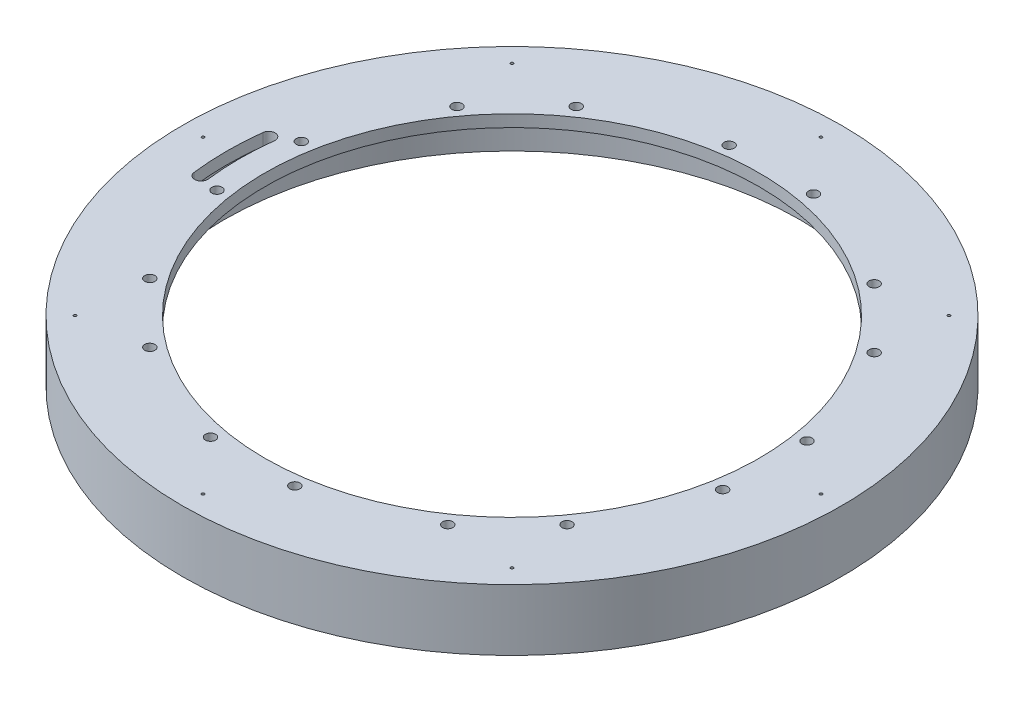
ISO-10303-21;
HEADER;
FILE_DESCRIPTION(('STEP AP214'),'2;1');
FILE_NAME('part.step','',(''),(''),'','','');
FILE_SCHEMA(('AUTOMOTIVE_DESIGN { 1 0 10303 214 1 1 1 1 }'));
ENDSEC;
DATA;
#1=APPLICATION_CONTEXT('core data for automotive mechanical design processes');
#2=APPLICATION_PROTOCOL_DEFINITION('international standard','automotive_design',2000,#1);
#3=PRODUCT_CONTEXT('',#1,'mechanical');
#4=PRODUCT('Part','Part','',(#3));
#5=PRODUCT_RELATED_PRODUCT_CATEGORY('part','',(#4));
#6=PRODUCT_DEFINITION_FORMATION('','',#4);
#7=PRODUCT_DEFINITION_CONTEXT('part definition',#1,'design');
#8=PRODUCT_DEFINITION('design','',#6,#7);
#9=PRODUCT_DEFINITION_SHAPE('','',#8);
#10=(LENGTH_UNIT() NAMED_UNIT(*) SI_UNIT(.MILLI.,.METRE.));
#11=(NAMED_UNIT(*) PLANE_ANGLE_UNIT() SI_UNIT($,.RADIAN.));
#12=(NAMED_UNIT(*) SI_UNIT($,.STERADIAN.) SOLID_ANGLE_UNIT());
#13=UNCERTAINTY_MEASURE_WITH_UNIT(LENGTH_MEASURE(1.E-05),#10,'distance_accuracy_value','');
#14=(GEOMETRIC_REPRESENTATION_CONTEXT(3) GLOBAL_UNCERTAINTY_ASSIGNED_CONTEXT((#13)) GLOBAL_UNIT_ASSIGNED_CONTEXT((#10,
#11,#12)) REPRESENTATION_CONTEXT('',''));
#15=CARTESIAN_POINT('',(0.,0.,0.));
#16=DIRECTION('',(0.,0.,1.));
#17=DIRECTION('',(1.,0.,0.));
#18=AXIS2_PLACEMENT_3D('',#15,#16,#17);
#19=CARTESIAN_POINT('',(0.,18.923,0.));
#20=DIRECTION('',(0.,-1.,0.));
#21=DIRECTION('',(0.,0.,-1.));
#22=AXIS2_PLACEMENT_3D('',#19,#20,#21);
#23=CYLINDRICAL_SURFACE('',#22,101.6);
#24=CARTESIAN_POINT('',(0.,18.923,0.));
#25=DIRECTION('',(0.,1.,0.));
#26=DIRECTION('',(0.,0.,1.));
#27=AXIS2_PLACEMENT_3D('',#24,#25,#26);
#28=CIRCLE('',#27,101.6);
#29=CARTESIAN_POINT('',(0.,18.923,101.6));
#30=VERTEX_POINT('',#29);
#31=EDGE_CURVE('E250',#30,#30,#28,.T.);
#32=ORIENTED_EDGE('',*,*,#31,.F.);
#33=EDGE_LOOP('',(#32));
#34=FACE_BOUND('',#33,.T.);
#35=CARTESIAN_POINT('',(0.,0.,0.));
#36=DIRECTION('',(0.,1.,0.));
#37=DIRECTION('',(0.,0.,1.));
#38=AXIS2_PLACEMENT_3D('',#35,#36,#37);
#39=CIRCLE('',#38,101.6);
#40=CARTESIAN_POINT('',(0.,0.,101.6));
#41=VERTEX_POINT('',#40);
#42=EDGE_CURVE('E246',#41,#41,#39,.T.);
#43=ORIENTED_EDGE('',*,*,#42,.T.);
#44=EDGE_LOOP('',(#43));
#45=FACE_BOUND('',#44,.T.);
#46=ADVANCED_FACE('F38',(#34,#45),#23,.T.);
#47=CARTESIAN_POINT('',(0.,18.923,0.));
#48=DIRECTION('',(0.,1.,0.));
#49=DIRECTION('',(0.,0.,1.));
#50=AXIS2_PLACEMENT_3D('',#47,#48,#49);
#51=PLANE('',#50);
#52=CARTESIAN_POINT('',(-85.2821646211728,18.923,-10.2599544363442));
#53=DIRECTION('',(0.,1.,0.));
#54=DIRECTION('',(0.,0.,1.));
#55=AXIS2_PLACEMENT_3D('',#52,#53,#54);
#56=CIRCLE('',#55,2.);
#57=CARTESIAN_POINT('',(-83.2964829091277,18.923,-10.0210650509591));
#58=VERTEX_POINT('',#57);
#59=CARTESIAN_POINT('',(-87.2678463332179,18.923,-10.4988438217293));
#60=VERTEX_POINT('',#59);
#61=EDGE_CURVE('E52',#58,#60,#56,.T.);
#62=ORIENTED_EDGE('',*,*,#61,.F.);
#63=CARTESIAN_POINT('',(0.,18.923,0.));
#64=DIRECTION('',(0.,-1.,0.));
#65=DIRECTION('',(0.,0.,1.));
#66=AXIS2_PLACEMENT_3D('',#63,#64,#65);
#67=CIRCLE('',#66,83.8971144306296);
#68=CARTESIAN_POINT('',(-83.258102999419,18.923,10.335090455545));
#69=VERTEX_POINT('',#68);
#70=EDGE_CURVE('E96',#69,#58,#67,.T.);
#71=ORIENTED_EDGE('',*,*,#70,.F.);
#72=CARTESIAN_POINT('',(-85.2428697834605,18.923,10.5814658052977));
#73=DIRECTION('',(0.,1.,0.));
#74=DIRECTION('',(0.,0.,1.));
#75=AXIS2_PLACEMENT_3D('',#72,#73,#74);
#76=CIRCLE('',#75,2.);
#77=CARTESIAN_POINT('',(-87.2276365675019,18.923,10.8278411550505));
#78=VERTEX_POINT('',#77);
#79=EDGE_CURVE('E80',#78,#69,#76,.T.);
#80=ORIENTED_EDGE('',*,*,#79,.F.);
#81=CARTESIAN_POINT('',(0.,18.923,0.));
#82=DIRECTION('',(0.,1.,0.));
#83=DIRECTION('',(0.,0.,1.));
#84=AXIS2_PLACEMENT_3D('',#81,#82,#83);
#85=CIRCLE('',#84,87.8971144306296);
#86=EDGE_CURVE('E89',#60,#78,#85,.T.);
#87=ORIENTED_EDGE('',*,*,#86,.F.);
#88=EDGE_LOOP('',(#62,#71,#80,#87));
#89=FACE_BOUND('',#88,.T.);
#90=CARTESIAN_POINT('',(47.3407990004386,18.923,-64.3113617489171));
#91=DIRECTION('',(0.,1.,0.));
#92=DIRECTION('',(0.,0.,1.));
#93=AXIS2_PLACEMENT_3D('',#90,#91,#92);
#94=CIRCLE('',#93,1.575);
#95=CARTESIAN_POINT('',(47.3407990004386,18.923,-62.7363617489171));
#96=VERTEX_POINT('',#95);
#97=EDGE_CURVE('E103',#96,#96,#94,.T.);
#98=ORIENTED_EDGE('',*,*,#97,.F.);
#99=EDGE_LOOP('',(#98));
#100=FACE_BOUND('',#99,.T.);
#101=CARTESIAN_POINT('',(65.725575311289,18.923,-45.9265854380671));
#102=DIRECTION('',(0.,1.,0.));
#103=DIRECTION('',(0.,0.,1.));
#104=AXIS2_PLACEMENT_3D('',#101,#102,#103);
#105=CIRCLE('',#104,1.57499999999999);
#106=CARTESIAN_POINT('',(65.725575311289,18.923,-44.3515854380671));
#107=VERTEX_POINT('',#106);
#108=EDGE_CURVE('E109',#107,#107,#105,.T.);
#109=ORIENTED_EDGE('',*,*,#108,.F.);
#110=EDGE_LOOP('',(#109));
#111=FACE_BOUND('',#110,.T.);
#112=CARTESIAN_POINT('',(78.9499999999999,18.923,-12.0000000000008));
#113=DIRECTION('',(0.,1.,0.));
#114=DIRECTION('',(0.,0.,1.));
#115=AXIS2_PLACEMENT_3D('',#112,#113,#114);
#116=CIRCLE('',#115,1.57499999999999);
#117=CARTESIAN_POINT('',(78.9499999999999,18.923,-10.4250000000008));
#118=VERTEX_POINT('',#117);
#119=EDGE_CURVE('E115',#118,#118,#116,.T.);
#120=ORIENTED_EDGE('',*,*,#119,.F.);
#121=EDGE_LOOP('',(#120));
#122=FACE_BOUND('',#121,.T.);
#123=CARTESIAN_POINT('',(78.9500000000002,18.923,13.9999999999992));
#124=DIRECTION('',(0.,1.,0.));
#125=DIRECTION('',(0.,0.,1.));
#126=AXIS2_PLACEMENT_3D('',#123,#124,#125);
#127=CIRCLE('',#126,1.57499999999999);
#128=CARTESIAN_POINT('',(78.9500000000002,18.923,15.5749999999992));
#129=VERTEX_POINT('',#128);
#130=EDGE_CURVE('E119',#129,#129,#127,.T.);
#131=ORIENTED_EDGE('',*,*,#130,.F.);
#132=EDGE_LOOP('',(#131));
#133=FACE_BOUND('',#132,.T.);
#134=CARTESIAN_POINT('',(64.3113617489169,18.923,47.3407990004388));
#135=DIRECTION('',(0.,1.,0.));
#136=DIRECTION('',(0.,0.,1.));
#137=AXIS2_PLACEMENT_3D('',#134,#135,#136);
#138=CIRCLE('',#137,1.57499999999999);
#139=CARTESIAN_POINT('',(64.3113617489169,18.923,48.9157990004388));
#140=VERTEX_POINT('',#139);
#141=EDGE_CURVE('E123',#140,#140,#138,.T.);
#142=ORIENTED_EDGE('',*,*,#141,.F.);
#143=EDGE_LOOP('',(#142));
#144=FACE_BOUND('',#143,.T.);
#145=CARTESIAN_POINT('',(45.9265854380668,18.923,65.7255753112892));
#146=DIRECTION('',(0.,1.,0.));
#147=DIRECTION('',(0.,0.,1.));
#148=AXIS2_PLACEMENT_3D('',#145,#146,#147);
#149=CIRCLE('',#148,1.575);
#150=CARTESIAN_POINT('',(45.9265854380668,18.923,67.3005753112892));
#151=VERTEX_POINT('',#150);
#152=EDGE_CURVE('E127',#151,#151,#149,.T.);
#153=ORIENTED_EDGE('',*,*,#152,.F.);
#154=EDGE_LOOP('',(#153));
#155=FACE_BOUND('',#154,.T.);
#156=CARTESIAN_POINT('',(12.,18.923,78.95));
#157=DIRECTION('',(0.,1.,0.));
#158=DIRECTION('',(0.,0.,1.));
#159=AXIS2_PLACEMENT_3D('',#156,#157,#158);
#160=CIRCLE('',#159,1.575);
#161=CARTESIAN_POINT('',(12.,18.923,80.525));
#162=VERTEX_POINT('',#161);
#163=EDGE_CURVE('E131',#162,#162,#160,.T.);
#164=ORIENTED_EDGE('',*,*,#163,.F.);
#165=EDGE_LOOP('',(#164));
#166=FACE_BOUND('',#165,.T.);
#167=CARTESIAN_POINT('',(-14.,18.923,78.95));
#168=DIRECTION('',(0.,1.,0.));
#169=DIRECTION('',(0.,0.,1.));
#170=AXIS2_PLACEMENT_3D('',#167,#168,#169);
#171=CIRCLE('',#170,1.575);
#172=CARTESIAN_POINT('',(-14.,18.923,80.525));
#173=VERTEX_POINT('',#172);
#174=EDGE_CURVE('E135',#173,#173,#171,.T.);
#175=ORIENTED_EDGE('',*,*,#174,.F.);
#176=EDGE_LOOP('',(#175));
#177=FACE_BOUND('',#176,.T.);
#178=CARTESIAN_POINT('',(-47.340799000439,18.923,64.3113617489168));
#179=DIRECTION('',(0.,1.,0.));
#180=DIRECTION('',(0.,0.,1.));
#181=AXIS2_PLACEMENT_3D('',#178,#179,#180);
#182=CIRCLE('',#181,1.575);
#183=CARTESIAN_POINT('',(-47.340799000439,18.923,65.8863617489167));
#184=VERTEX_POINT('',#183);
#185=EDGE_CURVE('E141',#184,#184,#182,.T.);
#186=ORIENTED_EDGE('',*,*,#185,.F.);
#187=EDGE_LOOP('',(#186));
#188=FACE_BOUND('',#187,.T.);
#189=CARTESIAN_POINT('',(-65.7255753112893,18.923,45.9265854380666));
#190=DIRECTION('',(0.,1.,0.));
#191=DIRECTION('',(0.,0.,1.));
#192=AXIS2_PLACEMENT_3D('',#189,#190,#191);
#193=CIRCLE('',#192,1.57499999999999);
#194=CARTESIAN_POINT('',(-65.7255753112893,18.923,47.5015854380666));
#195=VERTEX_POINT('',#194);
#196=EDGE_CURVE('E145',#195,#195,#193,.T.);
#197=ORIENTED_EDGE('',*,*,#196,.F.);
#198=EDGE_LOOP('',(#197));
#199=FACE_BOUND('',#198,.T.);
#200=CARTESIAN_POINT('',(-78.95,18.923,12.0000000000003));
#201=DIRECTION('',(0.,1.,0.));
#202=DIRECTION('',(0.,0.,1.));
#203=AXIS2_PLACEMENT_3D('',#200,#201,#202);
#204=CIRCLE('',#203,1.57499999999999);
#205=CARTESIAN_POINT('',(-78.95,18.923,13.5750000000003));
#206=VERTEX_POINT('',#205);
#207=EDGE_CURVE('E149',#206,#206,#204,.T.);
#208=ORIENTED_EDGE('',*,*,#207,.F.);
#209=EDGE_LOOP('',(#208));
#210=FACE_BOUND('',#209,.T.);
#211=CARTESIAN_POINT('',(-78.9500000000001,18.923,-13.9999999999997));
#212=DIRECTION('',(0.,1.,0.));
#213=DIRECTION('',(0.,0.,1.));
#214=AXIS2_PLACEMENT_3D('',#211,#212,#213);
#215=CIRCLE('',#214,1.57499999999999);
#216=CARTESIAN_POINT('',(-78.9500000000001,18.923,-12.4249999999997));
#217=VERTEX_POINT('',#216);
#218=EDGE_CURVE('E155',#217,#217,#215,.T.);
#219=ORIENTED_EDGE('',*,*,#218,.F.);
#220=EDGE_LOOP('',(#219));
#221=FACE_BOUND('',#220,.T.);
#222=CARTESIAN_POINT('',(-64.3113617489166,18.923,-47.3407990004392));
#223=DIRECTION('',(0.,1.,0.));
#224=DIRECTION('',(0.,0.,1.));
#225=AXIS2_PLACEMENT_3D('',#222,#223,#224);
#226=CIRCLE('',#225,1.57499999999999);
#227=CARTESIAN_POINT('',(-64.3113617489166,18.923,-45.7657990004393));
#228=VERTEX_POINT('',#227);
#229=EDGE_CURVE('E161',#228,#228,#226,.T.);
#230=ORIENTED_EDGE('',*,*,#229,.F.);
#231=EDGE_LOOP('',(#230));
#232=FACE_BOUND('',#231,.T.);
#233=CARTESIAN_POINT('',(-45.9265854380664,18.923,-65.7255753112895));
#234=DIRECTION('',(0.,1.,0.));
#235=DIRECTION('',(0.,0.,1.));
#236=AXIS2_PLACEMENT_3D('',#233,#234,#235);
#237=CIRCLE('',#236,1.575);
#238=CARTESIAN_POINT('',(-45.9265854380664,18.923,-64.1505753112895));
#239=VERTEX_POINT('',#238);
#240=EDGE_CURVE('E165',#239,#239,#237,.T.);
#241=ORIENTED_EDGE('',*,*,#240,.F.);
#242=EDGE_LOOP('',(#241));
#243=FACE_BOUND('',#242,.T.);
#244=CARTESIAN_POINT('',(-12.,18.923,-78.95));
#245=DIRECTION('',(0.,1.,0.));
#246=DIRECTION('',(0.,0.,1.));
#247=AXIS2_PLACEMENT_3D('',#244,#245,#246);
#248=CIRCLE('',#247,1.575);
#249=CARTESIAN_POINT('',(-12.,18.923,-77.375));
#250=VERTEX_POINT('',#249);
#251=EDGE_CURVE('E171',#250,#250,#248,.T.);
#252=ORIENTED_EDGE('',*,*,#251,.F.);
#253=EDGE_LOOP('',(#252));
#254=FACE_BOUND('',#253,.T.);
#255=CARTESIAN_POINT('',(14.,18.923,-78.95));
#256=DIRECTION('',(0.,1.,0.));
#257=DIRECTION('',(0.,0.,1.));
#258=AXIS2_PLACEMENT_3D('',#255,#256,#257);
#259=CIRCLE('',#258,1.575);
#260=CARTESIAN_POINT('',(14.,18.923,-77.375));
#261=VERTEX_POINT('',#260);
#262=EDGE_CURVE('E177',#261,#261,#259,.T.);
#263=ORIENTED_EDGE('',*,*,#262,.F.);
#264=EDGE_LOOP('',(#263));
#265=FACE_BOUND('',#264,.T.);
#266=CARTESIAN_POINT('',(-67.3519209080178,18.923,67.3519209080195));
#267=DIRECTION('',(0.,1.,0.));
#268=DIRECTION('',(0.,0.,1.));
#269=AXIS2_PLACEMENT_3D('',#266,#267,#268);
#270=CIRCLE('',#269,0.419111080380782);
#271=CARTESIAN_POINT('',(-67.3519209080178,18.923,66.9328098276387));
#272=VERTEX_POINT('',#271);
#273=EDGE_CURVE('E189',#272,#272,#270,.T.);
#274=ORIENTED_EDGE('',*,*,#273,.F.);
#275=EDGE_LOOP('',(#274));
#276=FACE_BOUND('',#275,.T.);
#277=CARTESIAN_POINT('',(-95.25,18.923,9.97690792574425E-13));
#278=DIRECTION('',(0.,1.,0.));
#279=DIRECTION('',(0.,0.,1.));
#280=AXIS2_PLACEMENT_3D('',#277,#278,#279);
#281=CIRCLE('',#280,0.419111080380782);
#282=CARTESIAN_POINT('',(-95.25,18.923,-0.419111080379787));
#283=VERTEX_POINT('',#282);
#284=EDGE_CURVE('E196',#283,#283,#281,.T.);
#285=ORIENTED_EDGE('',*,*,#284,.F.);
#286=EDGE_LOOP('',(#285));
#287=FACE_BOUND('',#286,.T.);
#288=CARTESIAN_POINT('',(-67.3519209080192,18.923,-67.3519209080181));
#289=DIRECTION('',(0.,1.,0.));
#290=DIRECTION('',(0.,0.,1.));
#291=AXIS2_PLACEMENT_3D('',#288,#289,#290);
#292=CIRCLE('',#291,0.419111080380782);
#293=CARTESIAN_POINT('',(-67.3519209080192,18.923,-67.7710319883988));
#294=VERTEX_POINT('',#293);
#295=EDGE_CURVE('E203',#294,#294,#292,.T.);
#296=ORIENTED_EDGE('',*,*,#295,.F.);
#297=EDGE_LOOP('',(#296));
#298=FACE_BOUND('',#297,.T.);
#299=CARTESIAN_POINT('',(0.,18.923,-95.25));
#300=DIRECTION('',(0.,1.,0.));
#301=DIRECTION('',(0.,0.,1.));
#302=AXIS2_PLACEMENT_3D('',#299,#300,#301);
#303=CIRCLE('',#302,0.419111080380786);
#304=CARTESIAN_POINT('',(0.,18.923,-95.6691110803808));
#305=VERTEX_POINT('',#304);
#306=EDGE_CURVE('E210',#305,#305,#303,.T.);
#307=ORIENTED_EDGE('',*,*,#306,.F.);
#308=EDGE_LOOP('',(#307));
#309=FACE_BOUND('',#308,.T.);
#310=CARTESIAN_POINT('',(67.3519209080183,18.923,-67.351920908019));
#311=DIRECTION('',(0.,1.,0.));
#312=DIRECTION('',(0.,0.,1.));
#313=AXIS2_PLACEMENT_3D('',#310,#311,#312);
#314=CIRCLE('',#313,0.419111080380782);
#315=CARTESIAN_POINT('',(67.3519209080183,18.923,-67.7710319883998));
#316=VERTEX_POINT('',#315);
#317=EDGE_CURVE('E217',#316,#316,#314,.T.);
#318=ORIENTED_EDGE('',*,*,#317,.F.);
#319=EDGE_LOOP('',(#318));
#320=FACE_BOUND('',#319,.T.);
#321=CARTESIAN_POINT('',(95.25,18.923,-3.32563597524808E-13));
#322=DIRECTION('',(0.,1.,0.));
#323=DIRECTION('',(0.,0.,1.));
#324=AXIS2_PLACEMENT_3D('',#321,#322,#323);
#325=CIRCLE('',#324,0.419111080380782);
#326=CARTESIAN_POINT('',(95.25,18.923,-0.419111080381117));
#327=VERTEX_POINT('',#326);
#328=EDGE_CURVE('E224',#327,#327,#325,.T.);
#329=ORIENTED_EDGE('',*,*,#328,.F.);
#330=EDGE_LOOP('',(#329));
#331=FACE_BOUND('',#330,.T.);
#332=CARTESIAN_POINT('',(67.3519209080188,18.923,67.3519209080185));
#333=DIRECTION('',(0.,1.,0.));
#334=DIRECTION('',(0.,0.,1.));
#335=AXIS2_PLACEMENT_3D('',#332,#333,#334);
#336=CIRCLE('',#335,0.419111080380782);
#337=CARTESIAN_POINT('',(67.3519209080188,18.923,66.9328098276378));
#338=VERTEX_POINT('',#337);
#339=EDGE_CURVE('E231',#338,#338,#336,.T.);
#340=ORIENTED_EDGE('',*,*,#339,.F.);
#341=EDGE_LOOP('',(#340));
#342=FACE_BOUND('',#341,.T.);
#343=CARTESIAN_POINT('',(0.,18.923,95.25));
#344=DIRECTION('',(0.,1.,0.));
#345=DIRECTION('',(0.,0.,1.));
#346=AXIS2_PLACEMENT_3D('',#343,#344,#345);
#347=CIRCLE('',#346,0.419111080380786);
#348=CARTESIAN_POINT('',(0.,18.923,94.8308889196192));
#349=VERTEX_POINT('',#348);
#350=EDGE_CURVE('E238',#349,#349,#347,.T.);
#351=ORIENTED_EDGE('',*,*,#350,.F.);
#352=EDGE_LOOP('',(#351));
#353=FACE_BOUND('',#352,.T.);
#354=CARTESIAN_POINT('',(0.,18.923,0.));
#355=DIRECTION('',(0.,1.,0.));
#356=DIRECTION('',(0.,0.,1.));
#357=AXIS2_PLACEMENT_3D('',#354,#355,#356);
#358=CIRCLE('',#357,76.2);
#359=CARTESIAN_POINT('',(0.,18.923,76.2));
#360=VERTEX_POINT('',#359);
#361=EDGE_CURVE('E239',#360,#360,#358,.T.);
#362=ORIENTED_EDGE('',*,*,#361,.F.);
#363=EDGE_LOOP('',(#362));
#364=FACE_BOUND('',#363,.T.);
#365=ORIENTED_EDGE('',*,*,#31,.T.);
#366=EDGE_LOOP('',(#365));
#367=FACE_BOUND('',#366,.T.);
#368=ADVANCED_FACE('F93',(#89,#100,#111,#122,#133,#144,#155,#166,#177,#188,#199,#210,#221,#232,
#243,#254,#265,#276,#287,#298,#309,#320,#331,#342,#353,#364,#367),#51,.T.);
#369=CARTESIAN_POINT('',(0.,0.,0.));
#370=DIRECTION('',(0.,1.,0.));
#371=DIRECTION('',(0.,0.,1.));
#372=AXIS2_PLACEMENT_3D('',#369,#370,#371);
#373=PLANE('',#372);
#374=CARTESIAN_POINT('',(-67.3519209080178,0.,67.3519209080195));
#375=DIRECTION('',(0.,-1.,0.));
#376=DIRECTION('',(0.,0.,-1.));
#377=AXIS2_PLACEMENT_3D('',#374,#375,#376);
#378=CIRCLE('',#377,3.3782);
#379=CARTESIAN_POINT('',(-67.3519209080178,0.,63.9737209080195));
#380=VERTEX_POINT('',#379);
#381=EDGE_CURVE('E183',#380,#380,#378,.T.);
#382=ORIENTED_EDGE('',*,*,#381,.F.);
#383=EDGE_LOOP('',(#382));
#384=FACE_BOUND('',#383,.T.);
#385=CARTESIAN_POINT('',(-95.25,0.,9.97690792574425E-13));
#386=DIRECTION('',(0.,-1.,0.));
#387=DIRECTION('',(0.,0.,-1.));
#388=AXIS2_PLACEMENT_3D('',#385,#386,#387);
#389=CIRCLE('',#388,3.3782);
#390=CARTESIAN_POINT('',(-95.25,0.,-3.378199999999));
#391=VERTEX_POINT('',#390);
#392=EDGE_CURVE('E190',#391,#391,#389,.T.);
#393=ORIENTED_EDGE('',*,*,#392,.F.);
#394=EDGE_LOOP('',(#393));
#395=FACE_BOUND('',#394,.T.);
#396=CARTESIAN_POINT('',(-67.3519209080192,0.,-67.3519209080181));
#397=DIRECTION('',(0.,-1.,0.));
#398=DIRECTION('',(0.,0.,-1.));
#399=AXIS2_PLACEMENT_3D('',#396,#397,#398);
#400=CIRCLE('',#399,3.3782);
#401=CARTESIAN_POINT('',(-67.3519209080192,0.,-70.7301209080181));
#402=VERTEX_POINT('',#401);
#403=EDGE_CURVE('E197',#402,#402,#400,.T.);
#404=ORIENTED_EDGE('',*,*,#403,.F.);
#405=EDGE_LOOP('',(#404));
#406=FACE_BOUND('',#405,.T.);
#407=CARTESIAN_POINT('',(0.,0.,-95.25));
#408=DIRECTION('',(0.,-1.,0.));
#409=DIRECTION('',(0.,0.,-1.));
#410=AXIS2_PLACEMENT_3D('',#407,#408,#409);
#411=CIRCLE('',#410,3.3782);
#412=CARTESIAN_POINT('',(0.,0.,-98.6282));
#413=VERTEX_POINT('',#412);
#414=EDGE_CURVE('E204',#413,#413,#411,.T.);
#415=ORIENTED_EDGE('',*,*,#414,.F.);
#416=EDGE_LOOP('',(#415));
#417=FACE_BOUND('',#416,.T.);
#418=CARTESIAN_POINT('',(67.3519209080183,0.,-67.351920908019));
#419=DIRECTION('',(0.,-1.,0.));
#420=DIRECTION('',(0.,0.,-1.));
#421=AXIS2_PLACEMENT_3D('',#418,#419,#420);
#422=CIRCLE('',#421,3.3782);
#423=CARTESIAN_POINT('',(67.3519209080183,0.,-70.730120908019));
#424=VERTEX_POINT('',#423);
#425=EDGE_CURVE('E211',#424,#424,#422,.T.);
#426=ORIENTED_EDGE('',*,*,#425,.F.);
#427=EDGE_LOOP('',(#426));
#428=FACE_BOUND('',#427,.T.);
#429=CARTESIAN_POINT('',(95.25,0.,-3.32563597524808E-13));
#430=DIRECTION('',(0.,-1.,0.));
#431=DIRECTION('',(0.,0.,-1.));
#432=AXIS2_PLACEMENT_3D('',#429,#430,#431);
#433=CIRCLE('',#432,3.3782);
#434=CARTESIAN_POINT('',(95.25,0.,-3.37820000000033));
#435=VERTEX_POINT('',#434);
#436=EDGE_CURVE('E218',#435,#435,#433,.T.);
#437=ORIENTED_EDGE('',*,*,#436,.F.);
#438=EDGE_LOOP('',(#437));
#439=FACE_BOUND('',#438,.T.);
#440=CARTESIAN_POINT('',(67.3519209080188,0.,67.3519209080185));
#441=DIRECTION('',(0.,-1.,0.));
#442=DIRECTION('',(0.,0.,-1.));
#443=AXIS2_PLACEMENT_3D('',#440,#441,#442);
#444=CIRCLE('',#443,3.3782);
#445=CARTESIAN_POINT('',(67.3519209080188,0.,63.9737209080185));
#446=VERTEX_POINT('',#445);
#447=EDGE_CURVE('E225',#446,#446,#444,.T.);
#448=ORIENTED_EDGE('',*,*,#447,.F.);
#449=EDGE_LOOP('',(#448));
#450=FACE_BOUND('',#449,.T.);
#451=CARTESIAN_POINT('',(0.,0.,95.25));
#452=DIRECTION('',(0.,-1.,0.));
#453=DIRECTION('',(0.,0.,-1.));
#454=AXIS2_PLACEMENT_3D('',#451,#452,#453);
#455=CIRCLE('',#454,3.3782);
#456=CARTESIAN_POINT('',(0.,0.,91.8718));
#457=VERTEX_POINT('',#456);
#458=EDGE_CURVE('E232',#457,#457,#455,.T.);
#459=ORIENTED_EDGE('',*,*,#458,.F.);
#460=EDGE_LOOP('',(#459));
#461=FACE_BOUND('',#460,.T.);
#462=CARTESIAN_POINT('',(0.,0.,0.));
#463=DIRECTION('',(0.,-1.,0.));
#464=DIRECTION('',(0.,0.,-1.));
#465=AXIS2_PLACEMENT_3D('',#462,#463,#464);
#466=CIRCLE('',#465,88.9);
#467=CARTESIAN_POINT('',(0.,0.,-88.9));
#468=VERTEX_POINT('',#467);
#469=EDGE_CURVE('E247',#468,#468,#466,.T.);
#470=ORIENTED_EDGE('',*,*,#469,.F.);
#471=EDGE_LOOP('',(#470));
#472=FACE_BOUND('',#471,.T.);
#473=ORIENTED_EDGE('',*,*,#42,.F.);
#474=EDGE_LOOP('',(#473));
#475=FACE_BOUND('',#474,.T.);
#476=ADVANCED_FACE('F319',(#384,#395,#406,#417,#428,#439,#450,#461,#472,#475),#373,.F.);
#477=CARTESIAN_POINT('',(0.,15.24,0.));
#478=DIRECTION('',(0.,-1.,0.));
#479=DIRECTION('',(0.,0.,-1.));
#480=AXIS2_PLACEMENT_3D('',#477,#478,#479);
#481=CYLINDRICAL_SURFACE('',#480,88.9);
#482=CARTESIAN_POINT('',(0.,15.24,0.));
#483=DIRECTION('',(0.,-1.,0.));
#484=DIRECTION('',(0.,0.,-1.));
#485=AXIS2_PLACEMENT_3D('',#482,#483,#484);
#486=CIRCLE('',#485,88.9);
#487=CARTESIAN_POINT('',(0.,15.24,-88.9));
#488=VERTEX_POINT('',#487);
#489=EDGE_CURVE('E243',#488,#488,#486,.T.);
#490=CARTESIAN_POINT('',(0.,15.24,-88.9));
#491=CARTESIAN_POINT('',(0.,15.08125,-88.9));
#492=CARTESIAN_POINT('',(0.,14.9225,-88.9));
#493=CARTESIAN_POINT('',(0.,14.605,-88.9));
#494=CARTESIAN_POINT('',(0.,14.44625,-88.9));
#495=CARTESIAN_POINT('',(0.,14.12875,-88.9));
#496=CARTESIAN_POINT('',(0.,13.97,-88.9));
#497=CARTESIAN_POINT('',(0.,13.6525,-88.9));
#498=CARTESIAN_POINT('',(0.,13.49375,-88.9));
#499=CARTESIAN_POINT('',(0.,13.17625,-88.9));
#500=CARTESIAN_POINT('',(0.,13.0175,-88.9));
#501=CARTESIAN_POINT('',(0.,12.7,-88.9));
#502=CARTESIAN_POINT('',(0.,12.54125,-88.9));
#503=CARTESIAN_POINT('',(0.,12.22375,-88.9));
#504=CARTESIAN_POINT('',(0.,12.065,-88.9));
#505=CARTESIAN_POINT('',(0.,11.7475,-88.9));
#506=CARTESIAN_POINT('',(0.,11.58875,-88.9));
#507=CARTESIAN_POINT('',(0.,11.27125,-88.9));
#508=CARTESIAN_POINT('',(0.,11.1125,-88.9));
#509=CARTESIAN_POINT('',(0.,10.795,-88.9));
#510=CARTESIAN_POINT('',(0.,10.63625,-88.9));
#511=CARTESIAN_POINT('',(0.,10.31875,-88.9));
#512=CARTESIAN_POINT('',(0.,10.16,-88.9));
#513=CARTESIAN_POINT('',(0.,9.8425,-88.9));
#514=CARTESIAN_POINT('',(0.,9.68375,-88.9));
#515=CARTESIAN_POINT('',(0.,9.36625,-88.9));
#516=CARTESIAN_POINT('',(0.,9.2075,-88.9));
#517=CARTESIAN_POINT('',(0.,8.89,-88.9));
#518=CARTESIAN_POINT('',(0.,8.73125,-88.9));
#519=CARTESIAN_POINT('',(0.,8.41375,-88.9));
#520=CARTESIAN_POINT('',(0.,8.255,-88.9));
#521=CARTESIAN_POINT('',(0.,7.9375,-88.9));
#522=CARTESIAN_POINT('',(0.,7.77875,-88.9));
#523=CARTESIAN_POINT('',(0.,7.46125,-88.9));
#524=CARTESIAN_POINT('',(0.,7.3025,-88.9));
#525=CARTESIAN_POINT('',(0.,6.985,-88.9));
#526=CARTESIAN_POINT('',(0.,6.82625,-88.9));
#527=CARTESIAN_POINT('',(0.,6.50875,-88.9));
#528=CARTESIAN_POINT('',(0.,6.35,-88.9));
#529=CARTESIAN_POINT('',(0.,6.0325,-88.9));
#530=CARTESIAN_POINT('',(0.,5.87375,-88.9));
#531=CARTESIAN_POINT('',(0.,5.55625,-88.9));
#532=CARTESIAN_POINT('',(0.,5.3975,-88.9));
#533=CARTESIAN_POINT('',(0.,5.08,-88.9));
#534=CARTESIAN_POINT('',(0.,4.92125,-88.9));
#535=CARTESIAN_POINT('',(0.,4.60375,-88.9));
#536=CARTESIAN_POINT('',(0.,4.445,-88.9));
#537=CARTESIAN_POINT('',(0.,4.1275,-88.9));
#538=CARTESIAN_POINT('',(0.,3.96875,-88.9));
#539=CARTESIAN_POINT('',(0.,3.65125,-88.9));
#540=CARTESIAN_POINT('',(0.,3.4925,-88.9));
#541=CARTESIAN_POINT('',(0.,3.175,-88.9));
#542=CARTESIAN_POINT('',(0.,3.01625,-88.9));
#543=CARTESIAN_POINT('',(0.,2.69875,-88.9));
#544=CARTESIAN_POINT('',(0.,2.54,-88.9));
#545=CARTESIAN_POINT('',(0.,2.2225,-88.9));
#546=CARTESIAN_POINT('',(0.,2.06375,-88.9));
#547=CARTESIAN_POINT('',(0.,1.74625,-88.9));
#548=CARTESIAN_POINT('',(0.,1.5875,-88.9));
#549=CARTESIAN_POINT('',(0.,1.27,-88.9));
#550=CARTESIAN_POINT('',(0.,1.11125,-88.9));
#551=CARTESIAN_POINT('',(0.,0.79375,-88.9));
#552=CARTESIAN_POINT('',(0.,0.634999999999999,-88.9));
#553=CARTESIAN_POINT('',(0.,0.3175,-88.9));
#554=CARTESIAN_POINT('',(0.,0.15875,-88.9));
#555=CARTESIAN_POINT('',(0.,0.,-88.9));
#556=B_SPLINE_CURVE_WITH_KNOTS('',3,(#490,#491,#492,#493,#494,#495,#496,#497,#498,#499,#500,
#501,#502,#503,#504,#505,#506,#507,#508,#509,#510,#511,#512,#513,#514,#515,#516,#517,#518,#519,
#520,#521,#522,#523,#524,#525,#526,#527,#528,#529,#530,#531,#532,#533,#534,#535,#536,#537,#538,
#539,#540,#541,#542,#543,#544,#545,#546,#547,#548,#549,#550,#551,#552,#553,#554,#555),
.UNSPECIFIED.,.F.,.F.,(4,2,2,2,2,2,2,2,2,2,2,2,2,2,2,2,2,2,2,2,2,2,2,2,2,2,2,2,2,2,2,2,4),(0.,
0.476249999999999,0.952499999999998,1.42875,1.905,2.38125,2.8575,3.33375,3.81,4.28625,4.7625,
5.23875,5.715,6.19125,6.6675,7.14375,7.62,8.09625,8.5725,9.04875,9.525,10.00125,10.4775,
10.95375,11.43,11.90625,12.3825,12.85875,13.335,13.81125,14.2875,14.76375,15.24),.UNSPECIFIED.);
#557=EDGE_CURVE('BSEAM326',#488,#468,#556,.T.);
#558=ORIENTED_EDGE('',*,*,#489,.F.);
#559=ORIENTED_EDGE('',*,*,#469,.T.);
#560=ORIENTED_EDGE('',*,*,#557,.T.);
#561=ORIENTED_EDGE('',*,*,#557,.F.);
#562=EDGE_LOOP('',(#558,#560,#559,#561));
#563=FACE_BOUND('',#562,.T.);
#564=ADVANCED_FACE('F326',(#563),#481,.F.);
#565=CARTESIAN_POINT('',(0.,15.24,0.));
#566=DIRECTION('',(0.,-1.,0.));
#567=DIRECTION('',(0.,0.,-1.));
#568=AXIS2_PLACEMENT_3D('',#565,#566,#567);
#569=PLANE('',#568);
#570=CARTESIAN_POINT('',(-85.2821646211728,15.24,-10.2599544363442));
#571=DIRECTION('',(0.,-1.,0.));
#572=DIRECTION('',(0.,0.,-1.));
#573=AXIS2_PLACEMENT_3D('',#570,#571,#572);
#574=CIRCLE('',#573,2.);
#575=CARTESIAN_POINT('',(-87.2678463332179,15.24,-10.4988438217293));
#576=VERTEX_POINT('',#575);
#577=CARTESIAN_POINT('',(-83.2964829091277,15.24,-10.0210650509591));
#578=VERTEX_POINT('',#577);
#579=EDGE_CURVE('E11',#576,#578,#574,.T.);
#580=ORIENTED_EDGE('',*,*,#579,.F.);
#581=CARTESIAN_POINT('',(0.,15.24,0.));
#582=DIRECTION('',(0.,-1.,0.));
#583=DIRECTION('',(0.,0.,-1.));
#584=AXIS2_PLACEMENT_3D('',#581,#582,#583);
#585=CIRCLE('',#584,87.8971144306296);
#586=CARTESIAN_POINT('',(-87.2276365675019,15.24,10.8278411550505));
#587=VERTEX_POINT('',#586);
#588=EDGE_CURVE('E253',#587,#576,#585,.T.);
#589=ORIENTED_EDGE('',*,*,#588,.F.);
#590=CARTESIAN_POINT('',(-85.2428697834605,15.24,10.5814658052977));
#591=DIRECTION('',(0.,-1.,0.));
#592=DIRECTION('',(0.,0.,-1.));
#593=AXIS2_PLACEMENT_3D('',#590,#591,#592);
#594=CIRCLE('',#593,2.);
#595=CARTESIAN_POINT('',(-83.258102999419,15.24,10.335090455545));
#596=VERTEX_POINT('',#595);
#597=EDGE_CURVE('E83',#596,#587,#594,.T.);
#598=ORIENTED_EDGE('',*,*,#597,.F.);
#599=CARTESIAN_POINT('',(0.,15.24,0.));
#600=DIRECTION('',(0.,-1.,0.));
#601=DIRECTION('',(0.,0.,-1.));
#602=AXIS2_PLACEMENT_3D('',#599,#600,#601);
#603=CIRCLE('',#602,83.8971144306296);
#604=EDGE_CURVE('E45',#578,#596,#603,.F.);
#605=ORIENTED_EDGE('',*,*,#604,.F.);
#606=EDGE_LOOP('',(#580,#589,#598,#605));
#607=FACE_BOUND('',#606,.T.);
#608=CARTESIAN_POINT('',(47.3407990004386,15.24,-64.3113617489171));
#609=DIRECTION('',(0.,-1.,0.));
#610=DIRECTION('',(0.,0.,-1.));
#611=AXIS2_PLACEMENT_3D('',#608,#609,#610);
#612=CIRCLE('',#611,1.575);
#613=CARTESIAN_POINT('',(47.3407990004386,15.24,-65.8863617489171));
#614=VERTEX_POINT('',#613);
#615=EDGE_CURVE('E108',#614,#614,#612,.T.);
#616=ORIENTED_EDGE('',*,*,#615,.F.);
#617=EDGE_LOOP('',(#616));
#618=FACE_BOUND('',#617,.T.);
#619=CARTESIAN_POINT('',(65.725575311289,15.24,-45.9265854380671));
#620=DIRECTION('',(0.,-1.,0.));
#621=DIRECTION('',(0.,0.,-1.));
#622=AXIS2_PLACEMENT_3D('',#619,#620,#621);
#623=CIRCLE('',#622,1.57499999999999);
#624=CARTESIAN_POINT('',(65.725575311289,15.24,-47.5015854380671));
#625=VERTEX_POINT('',#624);
#626=EDGE_CURVE('E112',#625,#625,#623,.T.);
#627=ORIENTED_EDGE('',*,*,#626,.F.);
#628=EDGE_LOOP('',(#627));
#629=FACE_BOUND('',#628,.T.);
#630=CARTESIAN_POINT('',(78.9499999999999,15.24,-12.0000000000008));
#631=DIRECTION('',(0.,-1.,0.));
#632=DIRECTION('',(0.,0.,-1.));
#633=AXIS2_PLACEMENT_3D('',#630,#631,#632);
#634=CIRCLE('',#633,1.57499999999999);
#635=CARTESIAN_POINT('',(78.9499999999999,15.24,-13.5750000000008));
#636=VERTEX_POINT('',#635);
#637=EDGE_CURVE('E118',#636,#636,#634,.T.);
#638=ORIENTED_EDGE('',*,*,#637,.F.);
#639=EDGE_LOOP('',(#638));
#640=FACE_BOUND('',#639,.T.);
#641=CARTESIAN_POINT('',(78.9500000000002,15.24,13.9999999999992));
#642=DIRECTION('',(0.,-1.,0.));
#643=DIRECTION('',(0.,0.,-1.));
#644=AXIS2_PLACEMENT_3D('',#641,#642,#643);
#645=CIRCLE('',#644,1.57499999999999);
#646=CARTESIAN_POINT('',(78.9500000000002,15.24,12.4249999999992));
#647=VERTEX_POINT('',#646);
#648=EDGE_CURVE('E122',#647,#647,#645,.T.);
#649=ORIENTED_EDGE('',*,*,#648,.F.);
#650=EDGE_LOOP('',(#649));
#651=FACE_BOUND('',#650,.T.);
#652=CARTESIAN_POINT('',(64.3113617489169,15.24,47.3407990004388));
#653=DIRECTION('',(0.,-1.,0.));
#654=DIRECTION('',(0.,0.,-1.));
#655=AXIS2_PLACEMENT_3D('',#652,#653,#654);
#656=CIRCLE('',#655,1.57499999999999);
#657=CARTESIAN_POINT('',(64.3113617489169,15.24,45.7657990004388));
#658=VERTEX_POINT('',#657);
#659=EDGE_CURVE('E126',#658,#658,#656,.T.);
#660=ORIENTED_EDGE('',*,*,#659,.F.);
#661=EDGE_LOOP('',(#660));
#662=FACE_BOUND('',#661,.T.);
#663=CARTESIAN_POINT('',(45.9265854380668,15.24,65.7255753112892));
#664=DIRECTION('',(0.,-1.,0.));
#665=DIRECTION('',(0.,0.,-1.));
#666=AXIS2_PLACEMENT_3D('',#663,#664,#665);
#667=CIRCLE('',#666,1.575);
#668=CARTESIAN_POINT('',(45.9265854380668,15.24,64.1505753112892));
#669=VERTEX_POINT('',#668);
#670=EDGE_CURVE('E130',#669,#669,#667,.T.);
#671=ORIENTED_EDGE('',*,*,#670,.F.);
#672=EDGE_LOOP('',(#671));
#673=FACE_BOUND('',#672,.T.);
#674=CARTESIAN_POINT('',(12.,15.24,78.95));
#675=DIRECTION('',(0.,-1.,0.));
#676=DIRECTION('',(0.,0.,-1.));
#677=AXIS2_PLACEMENT_3D('',#674,#675,#676);
#678=CIRCLE('',#677,1.575);
#679=CARTESIAN_POINT('',(12.,15.24,77.375));
#680=VERTEX_POINT('',#679);
#681=EDGE_CURVE('E134',#680,#680,#678,.T.);
#682=ORIENTED_EDGE('',*,*,#681,.F.);
#683=EDGE_LOOP('',(#682));
#684=FACE_BOUND('',#683,.T.);
#685=CARTESIAN_POINT('',(-14.,15.24,78.95));
#686=DIRECTION('',(0.,-1.,0.));
#687=DIRECTION('',(0.,0.,-1.));
#688=AXIS2_PLACEMENT_3D('',#685,#686,#687);
#689=CIRCLE('',#688,1.575);
#690=CARTESIAN_POINT('',(-14.,15.24,77.375));
#691=VERTEX_POINT('',#690);
#692=EDGE_CURVE('E138',#691,#691,#689,.T.);
#693=ORIENTED_EDGE('',*,*,#692,.F.);
#694=EDGE_LOOP('',(#693));
#695=FACE_BOUND('',#694,.T.);
#696=CARTESIAN_POINT('',(-47.340799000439,15.24,64.3113617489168));
#697=DIRECTION('',(0.,-1.,0.));
#698=DIRECTION('',(0.,0.,-1.));
#699=AXIS2_PLACEMENT_3D('',#696,#697,#698);
#700=CIRCLE('',#699,1.575);
#701=CARTESIAN_POINT('',(-47.340799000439,15.24,62.7363617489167));
#702=VERTEX_POINT('',#701);
#703=EDGE_CURVE('E144',#702,#702,#700,.T.);
#704=ORIENTED_EDGE('',*,*,#703,.F.);
#705=EDGE_LOOP('',(#704));
#706=FACE_BOUND('',#705,.T.);
#707=CARTESIAN_POINT('',(-65.7255753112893,15.24,45.9265854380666));
#708=DIRECTION('',(0.,-1.,0.));
#709=DIRECTION('',(0.,0.,-1.));
#710=AXIS2_PLACEMENT_3D('',#707,#708,#709);
#711=CIRCLE('',#710,1.57499999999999);
#712=CARTESIAN_POINT('',(-65.7255753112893,15.24,44.3515854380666));
#713=VERTEX_POINT('',#712);
#714=EDGE_CURVE('E148',#713,#713,#711,.T.);
#715=ORIENTED_EDGE('',*,*,#714,.F.);
#716=EDGE_LOOP('',(#715));
#717=FACE_BOUND('',#716,.T.);
#718=CARTESIAN_POINT('',(-78.95,15.24,12.0000000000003));
#719=DIRECTION('',(0.,-1.,0.));
#720=DIRECTION('',(0.,0.,-1.));
#721=AXIS2_PLACEMENT_3D('',#718,#719,#720);
#722=CIRCLE('',#721,1.57499999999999);
#723=CARTESIAN_POINT('',(-78.95,15.24,10.4250000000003));
#724=VERTEX_POINT('',#723);
#725=EDGE_CURVE('E152',#724,#724,#722,.T.);
#726=ORIENTED_EDGE('',*,*,#725,.F.);
#727=EDGE_LOOP('',(#726));
#728=FACE_BOUND('',#727,.T.);
#729=CARTESIAN_POINT('',(-78.9500000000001,15.24,-13.9999999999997));
#730=DIRECTION('',(0.,-1.,0.));
#731=DIRECTION('',(0.,0.,-1.));
#732=AXIS2_PLACEMENT_3D('',#729,#730,#731);
#733=CIRCLE('',#732,1.57499999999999);
#734=CARTESIAN_POINT('',(-78.9500000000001,15.24,-15.5749999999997));
#735=VERTEX_POINT('',#734);
#736=EDGE_CURVE('E158',#735,#735,#733,.T.);
#737=ORIENTED_EDGE('',*,*,#736,.F.);
#738=EDGE_LOOP('',(#737));
#739=FACE_BOUND('',#738,.T.);
#740=CARTESIAN_POINT('',(-64.3113617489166,15.24,-47.3407990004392));
#741=DIRECTION('',(0.,-1.,0.));
#742=DIRECTION('',(0.,0.,-1.));
#743=AXIS2_PLACEMENT_3D('',#740,#741,#742);
#744=CIRCLE('',#743,1.57499999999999);
#745=CARTESIAN_POINT('',(-64.3113617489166,15.24,-48.9157990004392));
#746=VERTEX_POINT('',#745);
#747=EDGE_CURVE('E164',#746,#746,#744,.T.);
#748=ORIENTED_EDGE('',*,*,#747,.F.);
#749=EDGE_LOOP('',(#748));
#750=FACE_BOUND('',#749,.T.);
#751=CARTESIAN_POINT('',(-45.9265854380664,15.24,-65.7255753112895));
#752=DIRECTION('',(0.,-1.,0.));
#753=DIRECTION('',(0.,0.,-1.));
#754=AXIS2_PLACEMENT_3D('',#751,#752,#753);
#755=CIRCLE('',#754,1.575);
#756=CARTESIAN_POINT('',(-45.9265854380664,15.24,-67.3005753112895));
#757=VERTEX_POINT('',#756);
#758=EDGE_CURVE('E168',#757,#757,#755,.T.);
#759=ORIENTED_EDGE('',*,*,#758,.F.);
#760=EDGE_LOOP('',(#759));
#761=FACE_BOUND('',#760,.T.);
#762=CARTESIAN_POINT('',(-12.,15.24,-78.95));
#763=DIRECTION('',(0.,-1.,0.));
#764=DIRECTION('',(0.,0.,-1.));
#765=AXIS2_PLACEMENT_3D('',#762,#763,#764);
#766=CIRCLE('',#765,1.575);
#767=CARTESIAN_POINT('',(-12.,15.24,-80.525));
#768=VERTEX_POINT('',#767);
#769=EDGE_CURVE('E174',#768,#768,#766,.T.);
#770=ORIENTED_EDGE('',*,*,#769,.F.);
#771=EDGE_LOOP('',(#770));
#772=FACE_BOUND('',#771,.T.);
#773=CARTESIAN_POINT('',(14.,15.24,-78.95));
#774=DIRECTION('',(0.,-1.,0.));
#775=DIRECTION('',(0.,0.,-1.));
#776=AXIS2_PLACEMENT_3D('',#773,#774,#775);
#777=CIRCLE('',#776,1.575);
#778=CARTESIAN_POINT('',(14.,15.24,-80.525));
#779=VERTEX_POINT('',#778);
#780=EDGE_CURVE('E180',#779,#779,#777,.T.);
#781=ORIENTED_EDGE('',*,*,#780,.F.);
#782=EDGE_LOOP('',(#781));
#783=FACE_BOUND('',#782,.T.);
#784=CARTESIAN_POINT('',(0.,15.24,0.));
#785=DIRECTION('',(0.,-1.,0.));
#786=DIRECTION('',(0.,0.,-1.));
#787=AXIS2_PLACEMENT_3D('',#784,#785,#786);
#788=CIRCLE('',#787,76.2);
#789=CARTESIAN_POINT('',(0.,15.24,-76.2));
#790=VERTEX_POINT('',#789);
#791=EDGE_CURVE('E242',#790,#790,#788,.T.);
#792=ORIENTED_EDGE('',*,*,#791,.F.);
#793=EDGE_LOOP('',(#792));
#794=FACE_BOUND('',#793,.T.);
#795=ORIENTED_EDGE('',*,*,#489,.T.);
#796=EDGE_LOOP('',(#795));
#797=FACE_BOUND('',#796,.T.);
#798=ADVANCED_FACE('F299',(#607,#618,#629,#640,#651,#662,#673,#684,#695,#706,#717,#728,#739,
#750,#761,#772,#783,#794,#797),#569,.T.);
#799=CARTESIAN_POINT('',(0.,0.,0.));
#800=DIRECTION('',(0.,1.,0.));
#801=DIRECTION('',(0.,0.,1.));
#802=AXIS2_PLACEMENT_3D('',#799,#800,#801);
#803=CYLINDRICAL_SURFACE('',#802,76.2);
#804=ORIENTED_EDGE('',*,*,#791,.T.);
#805=EDGE_LOOP('',(#804));
#806=FACE_BOUND('',#805,.T.);
#807=ORIENTED_EDGE('',*,*,#361,.T.);
#808=EDGE_LOOP('',(#807));
#809=FACE_BOUND('',#808,.T.);
#810=ADVANCED_FACE('F338',(#806,#809),#803,.F.);
#811=CARTESIAN_POINT('',(0.,17.145,95.25));
#812=DIRECTION('',(0.,-1.,0.));
#813=DIRECTION('',(0.,0.,-1.));
#814=AXIS2_PLACEMENT_3D('',#811,#812,#813);
#815=CONICAL_SURFACE('',#814,3.3782,1.02974425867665);
#816=CARTESIAN_POINT('',(0.,17.145,95.25));
#817=DIRECTION('',(0.,-1.,0.));
#818=DIRECTION('',(0.,0.,-1.));
#819=AXIS2_PLACEMENT_3D('',#816,#817,#818);
#820=CIRCLE('',#819,3.3782);
#821=CARTESIAN_POINT('',(0.,17.145,91.8718));
#822=VERTEX_POINT('',#821);
#823=EDGE_CURVE('E235',#822,#822,#820,.T.);
#824=CARTESIAN_POINT('',(0.,18.923,94.8308889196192));
#825=CARTESIAN_POINT('',(0.,18.9044791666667,94.8000650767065));
#826=CARTESIAN_POINT('',(0.,18.8859583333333,94.7692412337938));
#827=CARTESIAN_POINT('',(0.,18.8489166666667,94.7075935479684));
#828=CARTESIAN_POINT('',(0.,18.8303958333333,94.6767697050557));
#829=CARTESIAN_POINT('',(0.,18.7933541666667,94.6151220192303));
#830=CARTESIAN_POINT('',(0.,18.7748333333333,94.5842981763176));
#831=CARTESIAN_POINT('',(0.,18.7377916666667,94.5226504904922));
#832=CARTESIAN_POINT('',(0.,18.7192708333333,94.4918266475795));
#833=CARTESIAN_POINT('',(0.,18.6822291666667,94.4301789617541));
#834=CARTESIAN_POINT('',(0.,18.6637083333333,94.3993551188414));
#835=CARTESIAN_POINT('',(0.,18.6266666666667,94.337707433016));
#836=CARTESIAN_POINT('',(0.,18.6081458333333,94.3068835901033));
#837=CARTESIAN_POINT('',(0.,18.5711041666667,94.2452359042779));
#838=CARTESIAN_POINT('',(0.,18.5525833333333,94.2144120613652));
#839=CARTESIAN_POINT('',(0.,18.5155416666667,94.1527643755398));
#840=CARTESIAN_POINT('',(0.,18.4970208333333,94.1219405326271));
#841=CARTESIAN_POINT('',(0.,18.4599791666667,94.0602928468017));
#842=CARTESIAN_POINT('',(0.,18.4414583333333,94.029469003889));
#843=CARTESIAN_POINT('',(0.,18.4044166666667,93.9678213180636));
#844=CARTESIAN_POINT('',(0.,18.3858958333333,93.9369974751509));
#845=CARTESIAN_POINT('',(0.,18.3488541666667,93.8753497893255));
#846=CARTESIAN_POINT('',(0.,18.3303333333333,93.8445259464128));
#847=CARTESIAN_POINT('',(0.,18.2932916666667,93.7828782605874));
#848=CARTESIAN_POINT('',(0.,18.2747708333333,93.7520544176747));
#849=CARTESIAN_POINT('',(0.,18.2377291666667,93.6904067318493));
#850=CARTESIAN_POINT('',(0.,18.2192083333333,93.6595828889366));
#851=CARTESIAN_POINT('',(0.,18.1821666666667,93.5979352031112));
#852=CARTESIAN_POINT('',(0.,18.1636458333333,93.5671113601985));
#853=CARTESIAN_POINT('',(0.,18.1266041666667,93.5054636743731));
#854=CARTESIAN_POINT('',(0.,18.1080833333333,93.4746398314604));
#855=CARTESIAN_POINT('',(0.,18.0710416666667,93.412992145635));
#856=CARTESIAN_POINT('',(0.,18.0525208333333,93.3821683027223));
#857=CARTESIAN_POINT('',(0.,18.0154791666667,93.3205206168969));
#858=CARTESIAN_POINT('',(0.,17.9969583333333,93.2896967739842));
#859=CARTESIAN_POINT('',(0.,17.9599166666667,93.2280490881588));
#860=CARTESIAN_POINT('',(0.,17.9413958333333,93.1972252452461));
#861=CARTESIAN_POINT('',(0.,17.9043541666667,93.1355775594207));
#862=CARTESIAN_POINT('',(0.,17.8858333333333,93.104753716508));
#863=CARTESIAN_POINT('',(0.,17.8487916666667,93.0431060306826));
#864=CARTESIAN_POINT('',(0.,17.8302708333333,93.0122821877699));
#865=CARTESIAN_POINT('',(0.,17.7932291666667,92.9506345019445));
#866=CARTESIAN_POINT('',(0.,17.7747083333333,92.9198106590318));
#867=CARTESIAN_POINT('',(0.,17.7376666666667,92.8581629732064));
#868=CARTESIAN_POINT('',(0.,17.7191458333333,92.8273391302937));
#869=CARTESIAN_POINT('',(0.,17.6821041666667,92.7656914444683));
#870=CARTESIAN_POINT('',(0.,17.6635833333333,92.7348676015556));
#871=CARTESIAN_POINT('',(0.,17.6265416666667,92.6732199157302));
#872=CARTESIAN_POINT('',(0.,17.6080208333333,92.6423960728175));
#873=CARTESIAN_POINT('',(0.,17.5709791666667,92.5807483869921));
#874=CARTESIAN_POINT('',(0.,17.5524583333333,92.5499245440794));
#875=CARTESIAN_POINT('',(0.,17.5154166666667,92.488276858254));
#876=CARTESIAN_POINT('',(0.,17.4968958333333,92.4574530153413));
#877=CARTESIAN_POINT('',(0.,17.4598541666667,92.3958053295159));
#878=CARTESIAN_POINT('',(0.,17.4413333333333,92.3649814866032));
#879=CARTESIAN_POINT('',(0.,17.4042916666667,92.3033338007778));
#880=CARTESIAN_POINT('',(0.,17.3857708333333,92.2725099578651));
#881=CARTESIAN_POINT('',(0.,17.3487291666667,92.2108622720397));
#882=CARTESIAN_POINT('',(0.,17.3302083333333,92.180038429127));
#883=CARTESIAN_POINT('',(0.,17.2931666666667,92.1183907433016));
#884=CARTESIAN_POINT('',(0.,17.2746458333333,92.0875669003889));
#885=CARTESIAN_POINT('',(0.,17.2376041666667,92.0259192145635));
#886=CARTESIAN_POINT('',(0.,17.2190833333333,91.9950953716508));
#887=CARTESIAN_POINT('',(0.,17.1820416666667,91.9334476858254));
#888=CARTESIAN_POINT('',(0.,17.1635208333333,91.9026238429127));
#889=CARTESIAN_POINT('',(0.,17.145,91.8718));
#890=B_SPLINE_CURVE_WITH_KNOTS('',3,(#824,#825,#826,#827,#828,#829,#830,#831,#832,#833,#834,
#835,#836,#837,#838,#839,#840,#841,#842,#843,#844,#845,#846,#847,#848,#849,#850,#851,#852,#853,
#854,#855,#856,#857,#858,#859,#860,#861,#862,#863,#864,#865,#866,#867,#868,#869,#870,#871,#872,
#873,#874,#875,#876,#877,#878,#879,#880,#881,#882,#883,#884,#885,#886,#887,#888,#889),
.UNSPECIFIED.,.F.,.F.,(4,2,2,2,2,2,2,2,2,2,2,2,2,2,2,2,2,2,2,2,2,2,2,2,2,2,2,2,2,2,2,2,4),(0.,
0.107880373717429,0.215760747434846,0.323641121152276,0.431521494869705,0.539401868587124,
0.647282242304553,0.755162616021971,0.8630429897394,0.970923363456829,1.07880373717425,
1.18668411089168,1.29456448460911,1.40244485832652,1.51032523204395,1.61820560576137,
1.7260859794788,1.83396635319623,1.94184672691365,2.04972710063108,2.1576074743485,
2.26548784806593,2.37336822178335,2.48124859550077,2.5891289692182,2.69700934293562,
2.80488971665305,2.91277009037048,3.0206504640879,3.12853083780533,3.23641121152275,
3.34429158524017,3.4521719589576),.UNSPECIFIED.);
#891=EDGE_CURVE('BSEAM341',#349,#822,#890,.T.);
#892=ORIENTED_EDGE('',*,*,#350,.T.);
#893=ORIENTED_EDGE('',*,*,#823,.T.);
#894=ORIENTED_EDGE('',*,*,#891,.T.);
#895=ORIENTED_EDGE('',*,*,#891,.F.);
#896=EDGE_LOOP('',(#892,#894,#893,#895));
#897=FACE_BOUND('',#896,.T.);
#898=ADVANCED_FACE('F341',(#897),#815,.F.);
#899=CARTESIAN_POINT('',(0.,0.,95.25));
#900=DIRECTION('',(0.,-1.,0.));
#901=DIRECTION('',(0.,0.,-1.));
#902=AXIS2_PLACEMENT_3D('',#899,#900,#901);
#903=CYLINDRICAL_SURFACE('',#902,3.3782);
#904=ORIENTED_EDGE('',*,*,#823,.F.);
#905=EDGE_LOOP('',(#904));
#906=FACE_BOUND('',#905,.T.);
#907=ORIENTED_EDGE('',*,*,#458,.T.);
#908=EDGE_LOOP('',(#907));
#909=FACE_BOUND('',#908,.T.);
#910=ADVANCED_FACE('F345',(#906,#909),#903,.F.);
#911=CARTESIAN_POINT('',(67.3519209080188,17.145,67.3519209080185));
#912=DIRECTION('',(0.,-1.,0.));
#913=DIRECTION('',(0.,0.,-1.));
#914=AXIS2_PLACEMENT_3D('',#911,#912,#913);
#915=CONICAL_SURFACE('',#914,3.3782,1.02974425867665);
#916=CARTESIAN_POINT('',(67.3519209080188,17.145,67.3519209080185));
#917=DIRECTION('',(0.,-1.,0.));
#918=DIRECTION('',(0.,0.,-1.));
#919=AXIS2_PLACEMENT_3D('',#916,#917,#918);
#920=CIRCLE('',#919,3.3782);
#921=CARTESIAN_POINT('',(67.3519209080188,17.145,63.9737209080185));
#922=VERTEX_POINT('',#921);
#923=EDGE_CURVE('E228',#922,#922,#920,.T.);
#924=CARTESIAN_POINT('',(67.3519209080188,18.923,66.9328098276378));
#925=CARTESIAN_POINT('',(67.3519209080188,18.9044791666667,66.9019859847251));
#926=CARTESIAN_POINT('',(67.3519209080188,18.8859583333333,66.8711621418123));
#927=CARTESIAN_POINT('',(67.3519209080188,18.8489166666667,66.809514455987));
#928=CARTESIAN_POINT('',(67.3519209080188,18.8303958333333,66.7786906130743));
#929=CARTESIAN_POINT('',(67.3519209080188,18.7933541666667,66.7170429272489));
#930=CARTESIAN_POINT('',(67.3519209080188,18.7748333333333,66.6862190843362));
#931=CARTESIAN_POINT('',(67.3519209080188,18.7377916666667,66.6245713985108));
#932=CARTESIAN_POINT('',(67.3519209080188,18.7192708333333,66.5937475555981));
#933=CARTESIAN_POINT('',(67.3519209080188,18.6822291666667,66.5320998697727));
#934=CARTESIAN_POINT('',(67.3519209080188,18.6637083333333,66.50127602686));
#935=CARTESIAN_POINT('',(67.3519209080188,18.6266666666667,66.4396283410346));
#936=CARTESIAN_POINT('',(67.3519209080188,18.6081458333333,66.4088044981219));
#937=CARTESIAN_POINT('',(67.3519209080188,18.5711041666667,66.3471568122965));
#938=CARTESIAN_POINT('',(67.3519209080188,18.5525833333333,66.3163329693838));
#939=CARTESIAN_POINT('',(67.3519209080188,18.5155416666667,66.2546852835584));
#940=CARTESIAN_POINT('',(67.3519209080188,18.4970208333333,66.2238614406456));
#941=CARTESIAN_POINT('',(67.3519209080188,18.4599791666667,66.1622137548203));
#942=CARTESIAN_POINT('',(67.3519209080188,18.4414583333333,66.1313899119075));
#943=CARTESIAN_POINT('',(67.3519209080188,18.4044166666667,66.0697422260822));
#944=CARTESIAN_POINT('',(67.3519209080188,18.3858958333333,66.0389183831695));
#945=CARTESIAN_POINT('',(67.3519209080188,18.3488541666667,65.9772706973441));
#946=CARTESIAN_POINT('',(67.3519209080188,18.3303333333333,65.9464468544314));
#947=CARTESIAN_POINT('',(67.3519209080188,18.2932916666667,65.884799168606));
#948=CARTESIAN_POINT('',(67.3519209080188,18.2747708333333,65.8539753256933));
#949=CARTESIAN_POINT('',(67.3519209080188,18.2377291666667,65.7923276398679));
#950=CARTESIAN_POINT('',(67.3519209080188,18.2192083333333,65.7615037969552));
#951=CARTESIAN_POINT('',(67.3519209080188,18.1821666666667,65.6998561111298));
#952=CARTESIAN_POINT('',(67.3519209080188,18.1636458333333,65.6690322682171));
#953=CARTESIAN_POINT('',(67.3519209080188,18.1266041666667,65.6073845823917));
#954=CARTESIAN_POINT('',(67.3519209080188,18.1080833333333,65.5765607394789));
#955=CARTESIAN_POINT('',(67.3519209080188,18.0710416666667,65.5149130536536));
#956=CARTESIAN_POINT('',(67.3519209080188,18.0525208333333,65.4840892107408));
#957=CARTESIAN_POINT('',(67.3519209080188,18.0154791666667,65.4224415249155));
#958=CARTESIAN_POINT('',(67.3519209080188,17.9969583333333,65.3916176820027));
#959=CARTESIAN_POINT('',(67.3519209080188,17.9599166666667,65.3299699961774));
#960=CARTESIAN_POINT('',(67.3519209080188,17.9413958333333,65.2991461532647));
#961=CARTESIAN_POINT('',(67.3519209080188,17.9043541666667,65.2374984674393));
#962=CARTESIAN_POINT('',(67.3519209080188,17.8858333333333,65.2066746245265));
#963=CARTESIAN_POINT('',(67.3519209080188,17.8487916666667,65.1450269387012));
#964=CARTESIAN_POINT('',(67.3519209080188,17.8302708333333,65.1142030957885));
#965=CARTESIAN_POINT('',(67.3519209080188,17.7932291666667,65.0525554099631));
#966=CARTESIAN_POINT('',(67.3519209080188,17.7747083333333,65.0217315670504));
#967=CARTESIAN_POINT('',(67.3519209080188,17.7376666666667,64.960083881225));
#968=CARTESIAN_POINT('',(67.3519209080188,17.7191458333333,64.9292600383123));
#969=CARTESIAN_POINT('',(67.3519209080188,17.6821041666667,64.8676123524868));
#970=CARTESIAN_POINT('',(67.3519209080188,17.6635833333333,64.8367885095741));
#971=CARTESIAN_POINT('',(67.3519209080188,17.6265416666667,64.7751408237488));
#972=CARTESIAN_POINT('',(67.3519209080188,17.6080208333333,64.744316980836));
#973=CARTESIAN_POINT('',(67.3519209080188,17.5709791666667,64.6826692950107));
#974=CARTESIAN_POINT('',(67.3519209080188,17.5524583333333,64.651845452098));
#975=CARTESIAN_POINT('',(67.3519209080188,17.5154166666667,64.5901977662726));
#976=CARTESIAN_POINT('',(67.3519209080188,17.4968958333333,64.5593739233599));
#977=CARTESIAN_POINT('',(67.3519209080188,17.4598541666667,64.4977262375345));
#978=CARTESIAN_POINT('',(67.3519209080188,17.4413333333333,64.4669023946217));
#979=CARTESIAN_POINT('',(67.3519209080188,17.4042916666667,64.4052547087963));
#980=CARTESIAN_POINT('',(67.3519209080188,17.3857708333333,64.3744308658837));
#981=CARTESIAN_POINT('',(67.3519209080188,17.3487291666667,64.3127831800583));
#982=CARTESIAN_POINT('',(67.3519209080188,17.3302083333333,64.2819593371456));
#983=CARTESIAN_POINT('',(67.3519209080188,17.2931666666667,64.2203116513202));
#984=CARTESIAN_POINT('',(67.3519209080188,17.2746458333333,64.1894878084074));
#985=CARTESIAN_POINT('',(67.3519209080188,17.2376041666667,64.127840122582));
#986=CARTESIAN_POINT('',(67.3519209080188,17.2190833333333,64.0970162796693));
#987=CARTESIAN_POINT('',(67.3519209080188,17.1820416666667,64.035368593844));
#988=CARTESIAN_POINT('',(67.3519209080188,17.1635208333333,64.0045447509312));
#989=CARTESIAN_POINT('',(67.3519209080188,17.145,63.9737209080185));
#990=B_SPLINE_CURVE_WITH_KNOTS('',3,(#924,#925,#926,#927,#928,#929,#930,#931,#932,#933,#934,
#935,#936,#937,#938,#939,#940,#941,#942,#943,#944,#945,#946,#947,#948,#949,#950,#951,#952,#953,
#954,#955,#956,#957,#958,#959,#960,#961,#962,#963,#964,#965,#966,#967,#968,#969,#970,#971,#972,
#973,#974,#975,#976,#977,#978,#979,#980,#981,#982,#983,#984,#985,#986,#987,#988,#989),
.UNSPECIFIED.,.F.,.F.,(4,2,2,2,2,2,2,2,2,2,2,2,2,2,2,2,2,2,2,2,2,2,2,2,2,2,2,2,2,2,2,2,4),(0.,
0.107880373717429,0.215760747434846,0.323641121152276,0.431521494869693,0.539401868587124,
0.647282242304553,0.755162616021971,0.8630429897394,0.970923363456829,1.07880373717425,
1.18668411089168,1.2945644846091,1.40244485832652,1.51032523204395,1.61820560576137,
1.7260859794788,1.83396635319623,1.94184672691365,2.04972710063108,2.1576074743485,
2.26548784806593,2.37336822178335,2.48124859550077,2.5891289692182,2.69700934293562,
2.80488971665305,2.91277009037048,3.0206504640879,3.12853083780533,3.23641121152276,
3.34429158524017,3.4521719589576),.UNSPECIFIED.);
#991=EDGE_CURVE('BSEAM349',#338,#922,#990,.T.);
#992=ORIENTED_EDGE('',*,*,#339,.T.);
#993=ORIENTED_EDGE('',*,*,#923,.T.);
#994=ORIENTED_EDGE('',*,*,#991,.T.);
#995=ORIENTED_EDGE('',*,*,#991,.F.);
#996=EDGE_LOOP('',(#992,#994,#993,#995));
#997=FACE_BOUND('',#996,.T.);
#998=ADVANCED_FACE('F349',(#997),#915,.F.);
#999=CARTESIAN_POINT('',(67.3519209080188,0.,67.3519209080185));
#1000=DIRECTION('',(0.,-1.,0.));
#1001=DIRECTION('',(0.,0.,-1.));
#1002=AXIS2_PLACEMENT_3D('',#999,#1000,#1001);
#1003=CYLINDRICAL_SURFACE('',#1002,3.3782);
#1004=ORIENTED_EDGE('',*,*,#923,.F.);
#1005=EDGE_LOOP('',(#1004));
#1006=FACE_BOUND('',#1005,.T.);
#1007=ORIENTED_EDGE('',*,*,#447,.T.);
#1008=EDGE_LOOP('',(#1007));
#1009=FACE_BOUND('',#1008,.T.);
#1010=ADVANCED_FACE('F353',(#1006,#1009),#1003,.F.);
#1011=CARTESIAN_POINT('',(95.25,17.145,-3.32563597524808E-13));
#1012=DIRECTION('',(0.,-1.,0.));
#1013=DIRECTION('',(0.,0.,-1.));
#1014=AXIS2_PLACEMENT_3D('',#1011,#1012,#1013);
#1015=CONICAL_SURFACE('',#1014,3.3782,1.02974425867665);
#1016=CARTESIAN_POINT('',(95.25,17.145,-3.32563597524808E-13));
#1017=DIRECTION('',(0.,-1.,0.));
#1018=DIRECTION('',(0.,0.,-1.));
#1019=AXIS2_PLACEMENT_3D('',#1016,#1017,#1018);
#1020=CIRCLE('',#1019,3.3782);
#1021=CARTESIAN_POINT('',(95.25,17.145,-3.37820000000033));
#1022=VERTEX_POINT('',#1021);
#1023=EDGE_CURVE('E221',#1022,#1022,#1020,.T.);
#1024=CARTESIAN_POINT('',(95.25,18.923,-0.419111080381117));
#1025=CARTESIAN_POINT('',(95.25,18.9044791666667,-0.449934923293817));
#1026=CARTESIAN_POINT('',(95.25,18.8859583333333,-0.480758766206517));
#1027=CARTESIAN_POINT('',(95.25,18.8489166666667,-0.542406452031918));
#1028=CARTESIAN_POINT('',(95.25,18.8303958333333,-0.573230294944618));
#1029=CARTESIAN_POINT('',(95.25,18.7933541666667,-0.634877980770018));
#1030=CARTESIAN_POINT('',(95.25,18.7748333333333,-0.665701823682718));
#1031=CARTESIAN_POINT('',(95.25,18.7377916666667,-0.727349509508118));
#1032=CARTESIAN_POINT('',(95.25,18.7192708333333,-0.758173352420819));
#1033=CARTESIAN_POINT('',(95.25,18.6822291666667,-0.819821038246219));
#1034=CARTESIAN_POINT('',(95.25,18.6637083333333,-0.850644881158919));
#1035=CARTESIAN_POINT('',(95.25,18.6266666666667,-0.912292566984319));
#1036=CARTESIAN_POINT('',(95.25,18.6081458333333,-0.943116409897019));
#1037=CARTESIAN_POINT('',(95.25,18.5711041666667,-1.00476409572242));
#1038=CARTESIAN_POINT('',(95.25,18.5525833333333,-1.03558793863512));
#1039=CARTESIAN_POINT('',(95.25,18.5155416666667,-1.09723562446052));
#1040=CARTESIAN_POINT('',(95.25,18.4970208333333,-1.12805946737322));
#1041=CARTESIAN_POINT('',(95.25,18.4599791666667,-1.18970715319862));
#1042=CARTESIAN_POINT('',(95.25,18.4414583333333,-1.22053099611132));
#1043=CARTESIAN_POINT('',(95.25,18.4044166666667,-1.28217868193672));
#1044=CARTESIAN_POINT('',(95.25,18.3858958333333,-1.31300252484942));
#1045=CARTESIAN_POINT('',(95.25,18.3488541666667,-1.37465021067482));
#1046=CARTESIAN_POINT('',(95.25,18.3303333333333,-1.40547405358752));
#1047=CARTESIAN_POINT('',(95.25,18.2932916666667,-1.46712173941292));
#1048=CARTESIAN_POINT('',(95.25,18.2747708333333,-1.49794558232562));
#1049=CARTESIAN_POINT('',(95.25,18.2377291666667,-1.55959326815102));
#1050=CARTESIAN_POINT('',(95.25,18.2192083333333,-1.59041711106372));
#1051=CARTESIAN_POINT('',(95.25,18.1821666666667,-1.65206479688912));
#1052=CARTESIAN_POINT('',(95.25,18.1636458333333,-1.68288863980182));
#1053=CARTESIAN_POINT('',(95.25,18.1266041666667,-1.74453632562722));
#1054=CARTESIAN_POINT('',(95.25,18.1080833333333,-1.77536016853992));
#1055=CARTESIAN_POINT('',(95.25,18.0710416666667,-1.83700785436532));
#1056=CARTESIAN_POINT('',(95.25,18.0525208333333,-1.86783169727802));
#1057=CARTESIAN_POINT('',(95.25,18.0154791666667,-1.92947938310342));
#1058=CARTESIAN_POINT('',(95.25,17.9969583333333,-1.96030322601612));
#1059=CARTESIAN_POINT('',(95.25,17.9599166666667,-2.02195091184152));
#1060=CARTESIAN_POINT('',(95.25,17.9413958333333,-2.05277475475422));
#1061=CARTESIAN_POINT('',(95.25,17.9043541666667,-2.11442244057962));
#1062=CARTESIAN_POINT('',(95.25,17.8858333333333,-2.14524628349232));
#1063=CARTESIAN_POINT('',(95.25,17.8487916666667,-2.20689396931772));
#1064=CARTESIAN_POINT('',(95.25,17.8302708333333,-2.23771781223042));
#1065=CARTESIAN_POINT('',(95.25,17.7932291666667,-2.29936549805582));
#1066=CARTESIAN_POINT('',(95.25,17.7747083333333,-2.33018934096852));
#1067=CARTESIAN_POINT('',(95.25,17.7376666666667,-2.39183702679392));
#1068=CARTESIAN_POINT('',(95.25,17.7191458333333,-2.42266086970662));
#1069=CARTESIAN_POINT('',(95.25,17.6821041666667,-2.48430855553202));
#1070=CARTESIAN_POINT('',(95.25,17.6635833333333,-2.51513239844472));
#1071=CARTESIAN_POINT('',(95.25,17.6265416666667,-2.57678008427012));
#1072=CARTESIAN_POINT('',(95.25,17.6080208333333,-2.60760392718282));
#1073=CARTESIAN_POINT('',(95.25,17.5709791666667,-2.66925161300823));
#1074=CARTESIAN_POINT('',(95.25,17.5524583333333,-2.70007545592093));
#1075=CARTESIAN_POINT('',(95.25,17.5154166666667,-2.76172314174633));
#1076=CARTESIAN_POINT('',(95.25,17.4968958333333,-2.79254698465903));
#1077=CARTESIAN_POINT('',(95.25,17.4598541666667,-2.85419467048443));
#1078=CARTESIAN_POINT('',(95.25,17.4413333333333,-2.88501851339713));
#1079=CARTESIAN_POINT('',(95.25,17.4042916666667,-2.94666619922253));
#1080=CARTESIAN_POINT('',(95.25,17.3857708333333,-2.97749004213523));
#1081=CARTESIAN_POINT('',(95.25,17.3487291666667,-3.03913772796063));
#1082=CARTESIAN_POINT('',(95.25,17.3302083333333,-3.06996157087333));
#1083=CARTESIAN_POINT('',(95.25,17.2931666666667,-3.13160925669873));
#1084=CARTESIAN_POINT('',(95.25,17.2746458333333,-3.16243309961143));
#1085=CARTESIAN_POINT('',(95.25,17.2376041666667,-3.22408078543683));
#1086=CARTESIAN_POINT('',(95.25,17.2190833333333,-3.25490462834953));
#1087=CARTESIAN_POINT('',(95.25,17.1820416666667,-3.31655231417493));
#1088=CARTESIAN_POINT('',(95.25,17.1635208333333,-3.34737615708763));
#1089=CARTESIAN_POINT('',(95.25,17.145,-3.37820000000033));
#1090=B_SPLINE_CURVE_WITH_KNOTS('',3,(#1024,#1025,#1026,#1027,#1028,#1029,#1030,#1031,#1032,
#1033,#1034,#1035,#1036,#1037,#1038,#1039,#1040,#1041,#1042,#1043,#1044,#1045,#1046,#1047,#1048,
#1049,#1050,#1051,#1052,#1053,#1054,#1055,#1056,#1057,#1058,#1059,#1060,#1061,#1062,#1063,#1064,
#1065,#1066,#1067,#1068,#1069,#1070,#1071,#1072,#1073,#1074,#1075,#1076,#1077,#1078,#1079,#1080,
#1081,#1082,#1083,#1084,#1085,#1086,#1087,#1088,#1089),.UNSPECIFIED.,.F.,.F.,(4,2,2,2,2,2,2,2,2,
2,2,2,2,2,2,2,2,2,2,2,2,2,2,2,2,2,2,2,2,2,2,2,4),(0.,0.107880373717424,0.215760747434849,
0.323641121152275,0.431521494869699,0.539401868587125,0.647282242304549,0.755162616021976,
0.8630429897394,0.970923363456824,1.07880373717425,1.18668411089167,1.2945644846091,
1.40244485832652,1.51032523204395,1.61820560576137,1.7260859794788,1.83396635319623,
1.94184672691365,2.04972710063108,2.1576074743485,2.26548784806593,2.37336822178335,
2.48124859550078,2.5891289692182,2.69700934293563,2.80488971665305,2.91277009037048,
3.0206504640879,3.12853083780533,3.23641121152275,3.34429158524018,3.4521719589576),.UNSPECIFIED.);
#1091=EDGE_CURVE('BSEAM357',#327,#1022,#1090,.T.);
#1092=ORIENTED_EDGE('',*,*,#328,.T.);
#1093=ORIENTED_EDGE('',*,*,#1023,.T.);
#1094=ORIENTED_EDGE('',*,*,#1091,.T.);
#1095=ORIENTED_EDGE('',*,*,#1091,.F.);
#1096=EDGE_LOOP('',(#1092,#1094,#1093,#1095));
#1097=FACE_BOUND('',#1096,.T.);
#1098=ADVANCED_FACE('F357',(#1097),#1015,.F.);
#1099=CARTESIAN_POINT('',(95.25,0.,-3.32563597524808E-13));
#1100=DIRECTION('',(0.,-1.,0.));
#1101=DIRECTION('',(0.,0.,-1.));
#1102=AXIS2_PLACEMENT_3D('',#1099,#1100,#1101);
#1103=CYLINDRICAL_SURFACE('',#1102,3.3782);
#1104=ORIENTED_EDGE('',*,*,#1023,.F.);
#1105=EDGE_LOOP('',(#1104));
#1106=FACE_BOUND('',#1105,.T.);
#1107=ORIENTED_EDGE('',*,*,#436,.T.);
#1108=EDGE_LOOP('',(#1107));
#1109=FACE_BOUND('',#1108,.T.);
#1110=ADVANCED_FACE('F361',(#1106,#1109),#1103,.F.);
#1111=CARTESIAN_POINT('',(67.3519209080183,17.145,-67.351920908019));
#1112=DIRECTION('',(0.,-1.,0.));
#1113=DIRECTION('',(0.,0.,-1.));
#1114=AXIS2_PLACEMENT_3D('',#1111,#1112,#1113);
#1115=CONICAL_SURFACE('',#1114,3.3782,1.02974425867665);
#1116=CARTESIAN_POINT('',(67.3519209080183,17.145,-67.351920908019));
#1117=DIRECTION('',(0.,-1.,0.));
#1118=DIRECTION('',(0.,0.,-1.));
#1119=AXIS2_PLACEMENT_3D('',#1116,#1117,#1118);
#1120=CIRCLE('',#1119,3.3782);
#1121=CARTESIAN_POINT('',(67.3519209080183,17.145,-70.730120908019));
#1122=VERTEX_POINT('',#1121);
#1123=EDGE_CURVE('E214',#1122,#1122,#1120,.T.);
#1124=CARTESIAN_POINT('',(67.3519209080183,18.923,-67.7710319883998));
#1125=CARTESIAN_POINT('',(67.3519209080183,18.9044791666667,-67.8018558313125));
#1126=CARTESIAN_POINT('',(67.3519209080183,18.8859583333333,-67.8326796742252));
#1127=CARTESIAN_POINT('',(67.3519209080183,18.8489166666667,-67.8943273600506));
#1128=CARTESIAN_POINT('',(67.3519209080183,18.8303958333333,-67.9251512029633));
#1129=CARTESIAN_POINT('',(67.3519209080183,18.7933541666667,-67.9867988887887));
#1130=CARTESIAN_POINT('',(67.3519209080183,18.7748333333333,-68.0176227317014));
#1131=CARTESIAN_POINT('',(67.3519209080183,18.7377916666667,-68.0792704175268));
#1132=CARTESIAN_POINT('',(67.3519209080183,18.7192708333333,-68.1100942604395));
#1133=CARTESIAN_POINT('',(67.3519209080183,18.6822291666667,-68.1717419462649));
#1134=CARTESIAN_POINT('',(67.3519209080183,18.6637083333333,-68.2025657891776));
#1135=CARTESIAN_POINT('',(67.3519209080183,18.6266666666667,-68.264213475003));
#1136=CARTESIAN_POINT('',(67.3519209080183,18.6081458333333,-68.2950373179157));
#1137=CARTESIAN_POINT('',(67.3519209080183,18.5711041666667,-68.3566850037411));
#1138=CARTESIAN_POINT('',(67.3519209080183,18.5525833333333,-68.3875088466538));
#1139=CARTESIAN_POINT('',(67.3519209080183,18.5155416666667,-68.4491565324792));
#1140=CARTESIAN_POINT('',(67.3519209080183,18.4970208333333,-68.4799803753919));
#1141=CARTESIAN_POINT('',(67.3519209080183,18.4599791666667,-68.5416280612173));
#1142=CARTESIAN_POINT('',(67.3519209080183,18.4414583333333,-68.57245190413));
#1143=CARTESIAN_POINT('',(67.3519209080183,18.4044166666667,-68.6340995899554));
#1144=CARTESIAN_POINT('',(67.3519209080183,18.3858958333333,-68.6649234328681));
#1145=CARTESIAN_POINT('',(67.3519209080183,18.3488541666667,-68.7265711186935));
#1146=CARTESIAN_POINT('',(67.3519209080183,18.3303333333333,-68.7573949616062));
#1147=CARTESIAN_POINT('',(67.3519209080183,18.2932916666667,-68.8190426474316));
#1148=CARTESIAN_POINT('',(67.3519209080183,18.2747708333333,-68.8498664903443));
#1149=CARTESIAN_POINT('',(67.3519209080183,18.2377291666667,-68.9115141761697));
#1150=CARTESIAN_POINT('',(67.3519209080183,18.2192083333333,-68.9423380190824));
#1151=CARTESIAN_POINT('',(67.3519209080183,18.1821666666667,-69.0039857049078));
#1152=CARTESIAN_POINT('',(67.3519209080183,18.1636458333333,-69.0348095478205));
#1153=CARTESIAN_POINT('',(67.3519209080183,18.1266041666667,-69.0964572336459));
#1154=CARTESIAN_POINT('',(67.3519209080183,18.1080833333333,-69.1272810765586));
#1155=CARTESIAN_POINT('',(67.3519209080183,18.0710416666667,-69.188928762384));
#1156=CARTESIAN_POINT('',(67.3519209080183,18.0525208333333,-69.2197526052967));
#1157=CARTESIAN_POINT('',(67.3519209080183,18.0154791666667,-69.2814002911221));
#1158=CARTESIAN_POINT('',(67.3519209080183,17.9969583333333,-69.3122241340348));
#1159=CARTESIAN_POINT('',(67.3519209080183,17.9599166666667,-69.3738718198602));
#1160=CARTESIAN_POINT('',(67.3519209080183,17.9413958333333,-69.4046956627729));
#1161=CARTESIAN_POINT('',(67.3519209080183,17.9043541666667,-69.4663433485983));
#1162=CARTESIAN_POINT('',(67.3519209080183,17.8858333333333,-69.497167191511));
#1163=CARTESIAN_POINT('',(67.3519209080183,17.8487916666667,-69.5588148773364));
#1164=CARTESIAN_POINT('',(67.3519209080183,17.8302708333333,-69.5896387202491));
#1165=CARTESIAN_POINT('',(67.3519209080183,17.7932291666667,-69.6512864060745));
#1166=CARTESIAN_POINT('',(67.3519209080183,17.7747083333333,-69.6821102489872));
#1167=CARTESIAN_POINT('',(67.3519209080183,17.7376666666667,-69.7437579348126));
#1168=CARTESIAN_POINT('',(67.3519209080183,17.7191458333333,-69.7745817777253));
#1169=CARTESIAN_POINT('',(67.3519209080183,17.6821041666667,-69.8362294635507));
#1170=CARTESIAN_POINT('',(67.3519209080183,17.6635833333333,-69.8670533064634));
#1171=CARTESIAN_POINT('',(67.3519209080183,17.6265416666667,-69.9287009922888));
#1172=CARTESIAN_POINT('',(67.3519209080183,17.6080208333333,-69.9595248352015));
#1173=CARTESIAN_POINT('',(67.3519209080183,17.5709791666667,-70.0211725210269));
#1174=CARTESIAN_POINT('',(67.3519209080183,17.5524583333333,-70.0519963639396));
#1175=CARTESIAN_POINT('',(67.3519209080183,17.5154166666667,-70.113644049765));
#1176=CARTESIAN_POINT('',(67.3519209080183,17.4968958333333,-70.1444678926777));
#1177=CARTESIAN_POINT('',(67.3519209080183,17.4598541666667,-70.2061155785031));
#1178=CARTESIAN_POINT('',(67.3519209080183,17.4413333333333,-70.2369394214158));
#1179=CARTESIAN_POINT('',(67.3519209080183,17.4042916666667,-70.2985871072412));
#1180=CARTESIAN_POINT('',(67.3519209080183,17.3857708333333,-70.3294109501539));
#1181=CARTESIAN_POINT('',(67.3519209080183,17.3487291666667,-70.3910586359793));
#1182=CARTESIAN_POINT('',(67.3519209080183,17.3302083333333,-70.421882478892));
#1183=CARTESIAN_POINT('',(67.3519209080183,17.2931666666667,-70.4835301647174));
#1184=CARTESIAN_POINT('',(67.3519209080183,17.2746458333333,-70.5143540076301));
#1185=CARTESIAN_POINT('',(67.3519209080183,17.2376041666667,-70.5760016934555));
#1186=CARTESIAN_POINT('',(67.3519209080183,17.2190833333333,-70.6068255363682));
#1187=CARTESIAN_POINT('',(67.3519209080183,17.1820416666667,-70.6684732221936));
#1188=CARTESIAN_POINT('',(67.3519209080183,17.1635208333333,-70.6992970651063));
#1189=CARTESIAN_POINT('',(67.3519209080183,17.145,-70.730120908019));
#1190=B_SPLINE_CURVE_WITH_KNOTS('',3,(#1124,#1125,#1126,#1127,#1128,#1129,#1130,#1131,#1132,
#1133,#1134,#1135,#1136,#1137,#1138,#1139,#1140,#1141,#1142,#1143,#1144,#1145,#1146,#1147,#1148,
#1149,#1150,#1151,#1152,#1153,#1154,#1155,#1156,#1157,#1158,#1159,#1160,#1161,#1162,#1163,#1164,
#1165,#1166,#1167,#1168,#1169,#1170,#1171,#1172,#1173,#1174,#1175,#1176,#1177,#1178,#1179,#1180,
#1181,#1182,#1183,#1184,#1185,#1186,#1187,#1188,#1189),.UNSPECIFIED.,.F.,.F.,(4,2,2,2,2,2,2,2,2,
2,2,2,2,2,2,2,2,2,2,2,2,2,2,2,2,2,2,2,2,2,2,2,4),(0.,0.107880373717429,0.215760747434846,
0.323641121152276,0.431521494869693,0.539401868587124,0.647282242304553,0.755162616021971,
0.8630429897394,0.970923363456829,1.07880373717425,1.18668411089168,1.2945644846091,
1.40244485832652,1.51032523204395,1.61820560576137,1.7260859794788,1.83396635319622,
1.94184672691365,2.04972710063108,2.1576074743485,2.26548784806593,2.37336822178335,
2.48124859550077,2.5891289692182,2.69700934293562,2.80488971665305,2.91277009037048,
3.0206504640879,3.12853083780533,3.23641121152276,3.34429158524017,3.4521719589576),.UNSPECIFIED.);
#1191=EDGE_CURVE('BSEAM365',#316,#1122,#1190,.T.);
#1192=ORIENTED_EDGE('',*,*,#317,.T.);
#1193=ORIENTED_EDGE('',*,*,#1123,.T.);
#1194=ORIENTED_EDGE('',*,*,#1191,.T.);
#1195=ORIENTED_EDGE('',*,*,#1191,.F.);
#1196=EDGE_LOOP('',(#1192,#1194,#1193,#1195));
#1197=FACE_BOUND('',#1196,.T.);
#1198=ADVANCED_FACE('F365',(#1197),#1115,.F.);
#1199=CARTESIAN_POINT('',(67.3519209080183,0.,-67.351920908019));
#1200=DIRECTION('',(0.,-1.,0.));
#1201=DIRECTION('',(0.,0.,-1.));
#1202=AXIS2_PLACEMENT_3D('',#1199,#1200,#1201);
#1203=CYLINDRICAL_SURFACE('',#1202,3.3782);
#1204=ORIENTED_EDGE('',*,*,#1123,.F.);
#1205=EDGE_LOOP('',(#1204));
#1206=FACE_BOUND('',#1205,.T.);
#1207=ORIENTED_EDGE('',*,*,#425,.T.);
#1208=EDGE_LOOP('',(#1207));
#1209=FACE_BOUND('',#1208,.T.);
#1210=ADVANCED_FACE('F369',(#1206,#1209),#1203,.F.);
#1211=CARTESIAN_POINT('',(0.,17.145,-95.25));
#1212=DIRECTION('',(0.,-1.,0.));
#1213=DIRECTION('',(0.,0.,-1.));
#1214=AXIS2_PLACEMENT_3D('',#1211,#1212,#1213);
#1215=CONICAL_SURFACE('',#1214,3.3782,1.02974425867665);
#1216=CARTESIAN_POINT('',(0.,17.145,-95.25));
#1217=DIRECTION('',(0.,-1.,0.));
#1218=DIRECTION('',(0.,0.,-1.));
#1219=AXIS2_PLACEMENT_3D('',#1216,#1217,#1218);
#1220=CIRCLE('',#1219,3.3782);
#1221=CARTESIAN_POINT('',(0.,17.145,-98.6282));
#1222=VERTEX_POINT('',#1221);
#1223=EDGE_CURVE('E207',#1222,#1222,#1220,.T.);
#1224=CARTESIAN_POINT('',(0.,18.923,-95.6691110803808));
#1225=CARTESIAN_POINT('',(0.,18.9044791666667,-95.6999349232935));
#1226=CARTESIAN_POINT('',(0.,18.8859583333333,-95.7307587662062));
#1227=CARTESIAN_POINT('',(0.,18.8489166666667,-95.7924064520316));
#1228=CARTESIAN_POINT('',(0.,18.8303958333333,-95.8232302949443));
#1229=CARTESIAN_POINT('',(0.,18.7933541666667,-95.8848779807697));
#1230=CARTESIAN_POINT('',(0.,18.7748333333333,-95.9157018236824));
#1231=CARTESIAN_POINT('',(0.,18.7377916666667,-95.9773495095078));
#1232=CARTESIAN_POINT('',(0.,18.7192708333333,-96.0081733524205));
#1233=CARTESIAN_POINT('',(0.,18.6822291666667,-96.0698210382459));
#1234=CARTESIAN_POINT('',(0.,18.6637083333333,-96.1006448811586));
#1235=CARTESIAN_POINT('',(0.,18.6266666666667,-96.162292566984));
#1236=CARTESIAN_POINT('',(0.,18.6081458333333,-96.1931164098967));
#1237=CARTESIAN_POINT('',(0.,18.5711041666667,-96.2547640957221));
#1238=CARTESIAN_POINT('',(0.,18.5525833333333,-96.2855879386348));
#1239=CARTESIAN_POINT('',(0.,18.5155416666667,-96.3472356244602));
#1240=CARTESIAN_POINT('',(0.,18.4970208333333,-96.3780594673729));
#1241=CARTESIAN_POINT('',(0.,18.4599791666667,-96.4397071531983));
#1242=CARTESIAN_POINT('',(0.,18.4414583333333,-96.470530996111));
#1243=CARTESIAN_POINT('',(0.,18.4044166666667,-96.5321786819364));
#1244=CARTESIAN_POINT('',(0.,18.3858958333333,-96.5630025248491));
#1245=CARTESIAN_POINT('',(0.,18.3488541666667,-96.6246502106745));
#1246=CARTESIAN_POINT('',(0.,18.3303333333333,-96.6554740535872));
#1247=CARTESIAN_POINT('',(0.,18.2932916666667,-96.7171217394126));
#1248=CARTESIAN_POINT('',(0.,18.2747708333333,-96.7479455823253));
#1249=CARTESIAN_POINT('',(0.,18.2377291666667,-96.8095932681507));
#1250=CARTESIAN_POINT('',(0.,18.2192083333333,-96.8404171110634));
#1251=CARTESIAN_POINT('',(0.,18.1821666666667,-96.9020647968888));
#1252=CARTESIAN_POINT('',(0.,18.1636458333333,-96.9328886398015));
#1253=CARTESIAN_POINT('',(0.,18.1266041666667,-96.9945363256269));
#1254=CARTESIAN_POINT('',(0.,18.1080833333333,-97.0253601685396));
#1255=CARTESIAN_POINT('',(0.,18.0710416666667,-97.087007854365));
#1256=CARTESIAN_POINT('',(0.,18.0525208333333,-97.1178316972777));
#1257=CARTESIAN_POINT('',(0.,18.0154791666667,-97.1794793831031));
#1258=CARTESIAN_POINT('',(0.,17.9969583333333,-97.2103032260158));
#1259=CARTESIAN_POINT('',(0.,17.9599166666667,-97.2719509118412));
#1260=CARTESIAN_POINT('',(0.,17.9413958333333,-97.3027747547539));
#1261=CARTESIAN_POINT('',(0.,17.9043541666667,-97.3644224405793));
#1262=CARTESIAN_POINT('',(0.,17.8858333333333,-97.395246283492));
#1263=CARTESIAN_POINT('',(0.,17.8487916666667,-97.4568939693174));
#1264=CARTESIAN_POINT('',(0.,17.8302708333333,-97.4877178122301));
#1265=CARTESIAN_POINT('',(0.,17.7932291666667,-97.5493654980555));
#1266=CARTESIAN_POINT('',(0.,17.7747083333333,-97.5801893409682));
#1267=CARTESIAN_POINT('',(0.,17.7376666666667,-97.6418370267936));
#1268=CARTESIAN_POINT('',(0.,17.7191458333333,-97.6726608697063));
#1269=CARTESIAN_POINT('',(0.,17.6821041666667,-97.7343085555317));
#1270=CARTESIAN_POINT('',(0.,17.6635833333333,-97.7651323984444));
#1271=CARTESIAN_POINT('',(0.,17.6265416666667,-97.8267800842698));
#1272=CARTESIAN_POINT('',(0.,17.6080208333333,-97.8576039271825));
#1273=CARTESIAN_POINT('',(0.,17.5709791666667,-97.9192516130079));
#1274=CARTESIAN_POINT('',(0.,17.5524583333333,-97.9500754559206));
#1275=CARTESIAN_POINT('',(0.,17.5154166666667,-98.011723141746));
#1276=CARTESIAN_POINT('',(0.,17.4968958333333,-98.0425469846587));
#1277=CARTESIAN_POINT('',(0.,17.4598541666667,-98.1041946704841));
#1278=CARTESIAN_POINT('',(0.,17.4413333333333,-98.1350185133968));
#1279=CARTESIAN_POINT('',(0.,17.4042916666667,-98.1966661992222));
#1280=CARTESIAN_POINT('',(0.,17.3857708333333,-98.2274900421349));
#1281=CARTESIAN_POINT('',(0.,17.3487291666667,-98.2891377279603));
#1282=CARTESIAN_POINT('',(0.,17.3302083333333,-98.319961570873));
#1283=CARTESIAN_POINT('',(0.,17.2931666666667,-98.3816092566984));
#1284=CARTESIAN_POINT('',(0.,17.2746458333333,-98.4124330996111));
#1285=CARTESIAN_POINT('',(0.,17.2376041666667,-98.4740807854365));
#1286=CARTESIAN_POINT('',(0.,17.2190833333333,-98.5049046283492));
#1287=CARTESIAN_POINT('',(0.,17.1820416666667,-98.5665523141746));
#1288=CARTESIAN_POINT('',(0.,17.1635208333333,-98.5973761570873));
#1289=CARTESIAN_POINT('',(0.,17.145,-98.6282));
#1290=B_SPLINE_CURVE_WITH_KNOTS('',3,(#1224,#1225,#1226,#1227,#1228,#1229,#1230,#1231,#1232,
#1233,#1234,#1235,#1236,#1237,#1238,#1239,#1240,#1241,#1242,#1243,#1244,#1245,#1246,#1247,#1248,
#1249,#1250,#1251,#1252,#1253,#1254,#1255,#1256,#1257,#1258,#1259,#1260,#1261,#1262,#1263,#1264,
#1265,#1266,#1267,#1268,#1269,#1270,#1271,#1272,#1273,#1274,#1275,#1276,#1277,#1278,#1279,#1280,
#1281,#1282,#1283,#1284,#1285,#1286,#1287,#1288,#1289),.UNSPECIFIED.,.F.,.F.,(4,2,2,2,2,2,2,2,2,
2,2,2,2,2,2,2,2,2,2,2,2,2,2,2,2,2,2,2,2,2,2,2,4),(0.,0.107880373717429,0.215760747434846,
0.323641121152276,0.431521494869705,0.539401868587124,0.647282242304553,0.755162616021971,
0.8630429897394,0.970923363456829,1.07880373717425,1.18668411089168,1.29456448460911,
1.40244485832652,1.51032523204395,1.61820560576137,1.7260859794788,1.83396635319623,
1.94184672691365,2.04972710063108,2.1576074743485,2.26548784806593,2.37336822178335,
2.48124859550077,2.5891289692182,2.69700934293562,2.80488971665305,2.91277009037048,
3.0206504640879,3.12853083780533,3.23641121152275,3.34429158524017,3.4521719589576),.UNSPECIFIED.);
#1291=EDGE_CURVE('BSEAM373',#305,#1222,#1290,.T.);
#1292=ORIENTED_EDGE('',*,*,#306,.T.);
#1293=ORIENTED_EDGE('',*,*,#1223,.T.);
#1294=ORIENTED_EDGE('',*,*,#1291,.T.);
#1295=ORIENTED_EDGE('',*,*,#1291,.F.);
#1296=EDGE_LOOP('',(#1292,#1294,#1293,#1295));
#1297=FACE_BOUND('',#1296,.T.);
#1298=ADVANCED_FACE('F373',(#1297),#1215,.F.);
#1299=CARTESIAN_POINT('',(0.,0.,-95.25));
#1300=DIRECTION('',(0.,-1.,0.));
#1301=DIRECTION('',(0.,0.,-1.));
#1302=AXIS2_PLACEMENT_3D('',#1299,#1300,#1301);
#1303=CYLINDRICAL_SURFACE('',#1302,3.3782);
#1304=ORIENTED_EDGE('',*,*,#1223,.F.);
#1305=EDGE_LOOP('',(#1304));
#1306=FACE_BOUND('',#1305,.T.);
#1307=ORIENTED_EDGE('',*,*,#414,.T.);
#1308=EDGE_LOOP('',(#1307));
#1309=FACE_BOUND('',#1308,.T.);
#1310=ADVANCED_FACE('F377',(#1306,#1309),#1303,.F.);
#1311=CARTESIAN_POINT('',(-67.3519209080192,17.145,-67.3519209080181));
#1312=DIRECTION('',(0.,-1.,0.));
#1313=DIRECTION('',(0.,0.,-1.));
#1314=AXIS2_PLACEMENT_3D('',#1311,#1312,#1313);
#1315=CONICAL_SURFACE('',#1314,3.3782,1.02974425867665);
#1316=CARTESIAN_POINT('',(-67.3519209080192,17.145,-67.3519209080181));
#1317=DIRECTION('',(0.,-1.,0.));
#1318=DIRECTION('',(0.,0.,-1.));
#1319=AXIS2_PLACEMENT_3D('',#1316,#1317,#1318);
#1320=CIRCLE('',#1319,3.3782);
#1321=CARTESIAN_POINT('',(-67.3519209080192,17.145,-70.7301209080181));
#1322=VERTEX_POINT('',#1321);
#1323=EDGE_CURVE('E200',#1322,#1322,#1320,.T.);
#1324=CARTESIAN_POINT('',(-67.3519209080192,18.923,-67.7710319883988));
#1325=CARTESIAN_POINT('',(-67.3519209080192,18.9044791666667,-67.8018558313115));
#1326=CARTESIAN_POINT('',(-67.3519209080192,18.8859583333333,-67.8326796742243));
#1327=CARTESIAN_POINT('',(-67.3519209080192,18.8489166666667,-67.8943273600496));
#1328=CARTESIAN_POINT('',(-67.3519209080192,18.8303958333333,-67.9251512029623));
#1329=CARTESIAN_POINT('',(-67.3519209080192,18.7933541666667,-67.9867988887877));
#1330=CARTESIAN_POINT('',(-67.3519209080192,18.7748333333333,-68.0176227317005));
#1331=CARTESIAN_POINT('',(-67.3519209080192,18.7377916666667,-68.0792704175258));
#1332=CARTESIAN_POINT('',(-67.3519209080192,18.7192708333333,-68.1100942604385));
#1333=CARTESIAN_POINT('',(-67.3519209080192,18.6822291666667,-68.1717419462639));
#1334=CARTESIAN_POINT('',(-67.3519209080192,18.6637083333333,-68.2025657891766));
#1335=CARTESIAN_POINT('',(-67.3519209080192,18.6266666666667,-68.264213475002));
#1336=CARTESIAN_POINT('',(-67.3519209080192,18.6081458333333,-68.2950373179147));
#1337=CARTESIAN_POINT('',(-67.3519209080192,18.5711041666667,-68.3566850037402));
#1338=CARTESIAN_POINT('',(-67.3519209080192,18.5525833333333,-68.3875088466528));
#1339=CARTESIAN_POINT('',(-67.3519209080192,18.5155416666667,-68.4491565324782));
#1340=CARTESIAN_POINT('',(-67.3519209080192,18.4970208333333,-68.479980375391));
#1341=CARTESIAN_POINT('',(-67.3519209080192,18.4599791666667,-68.5416280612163));
#1342=CARTESIAN_POINT('',(-67.3519209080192,18.4414583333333,-68.5724519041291));
#1343=CARTESIAN_POINT('',(-67.3519209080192,18.4044166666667,-68.6340995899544));
#1344=CARTESIAN_POINT('',(-67.3519209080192,18.3858958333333,-68.6649234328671));
#1345=CARTESIAN_POINT('',(-67.3519209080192,18.3488541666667,-68.7265711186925));
#1346=CARTESIAN_POINT('',(-67.3519209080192,18.3303333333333,-68.7573949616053));
#1347=CARTESIAN_POINT('',(-67.3519209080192,18.2932916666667,-68.8190426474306));
#1348=CARTESIAN_POINT('',(-67.3519209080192,18.2747708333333,-68.8498664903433));
#1349=CARTESIAN_POINT('',(-67.3519209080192,18.2377291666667,-68.9115141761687));
#1350=CARTESIAN_POINT('',(-67.3519209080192,18.2192083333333,-68.9423380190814));
#1351=CARTESIAN_POINT('',(-67.3519209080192,18.1821666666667,-69.0039857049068));
#1352=CARTESIAN_POINT('',(-67.3519209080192,18.1636458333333,-69.0348095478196));
#1353=CARTESIAN_POINT('',(-67.3519209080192,18.1266041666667,-69.096457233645));
#1354=CARTESIAN_POINT('',(-67.3519209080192,18.1080833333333,-69.1272810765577));
#1355=CARTESIAN_POINT('',(-67.3519209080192,18.0710416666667,-69.188928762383));
#1356=CARTESIAN_POINT('',(-67.3519209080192,18.0525208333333,-69.2197526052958));
#1357=CARTESIAN_POINT('',(-67.3519209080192,18.0154791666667,-69.2814002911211));
#1358=CARTESIAN_POINT('',(-67.3519209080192,17.9969583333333,-69.3122241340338));
#1359=CARTESIAN_POINT('',(-67.3519209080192,17.9599166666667,-69.3738718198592));
#1360=CARTESIAN_POINT('',(-67.3519209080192,17.9413958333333,-69.404695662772));
#1361=CARTESIAN_POINT('',(-67.3519209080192,17.9043541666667,-69.4663433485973));
#1362=CARTESIAN_POINT('',(-67.3519209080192,17.8858333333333,-69.4971671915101));
#1363=CARTESIAN_POINT('',(-67.3519209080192,17.8487916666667,-69.5588148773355));
#1364=CARTESIAN_POINT('',(-67.3519209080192,17.8302708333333,-69.5896387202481));
#1365=CARTESIAN_POINT('',(-67.3519209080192,17.7932291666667,-69.6512864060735));
#1366=CARTESIAN_POINT('',(-67.3519209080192,17.7747083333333,-69.6821102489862));
#1367=CARTESIAN_POINT('',(-67.3519209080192,17.7376666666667,-69.7437579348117));
#1368=CARTESIAN_POINT('',(-67.3519209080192,17.7191458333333,-69.7745817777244));
#1369=CARTESIAN_POINT('',(-67.3519209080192,17.6821041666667,-69.8362294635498));
#1370=CARTESIAN_POINT('',(-67.3519209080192,17.6635833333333,-69.8670533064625));
#1371=CARTESIAN_POINT('',(-67.3519209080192,17.6265416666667,-69.9287009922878));
#1372=CARTESIAN_POINT('',(-67.3519209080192,17.6080208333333,-69.9595248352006));
#1373=CARTESIAN_POINT('',(-67.3519209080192,17.5709791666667,-70.0211725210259));
#1374=CARTESIAN_POINT('',(-67.3519209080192,17.5524583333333,-70.0519963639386));
#1375=CARTESIAN_POINT('',(-67.3519209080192,17.5154166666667,-70.113644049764));
#1376=CARTESIAN_POINT('',(-67.3519209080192,17.4968958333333,-70.1444678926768));
#1377=CARTESIAN_POINT('',(-67.3519209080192,17.4598541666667,-70.2061155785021));
#1378=CARTESIAN_POINT('',(-67.3519209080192,17.4413333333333,-70.2369394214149));
#1379=CARTESIAN_POINT('',(-67.3519209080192,17.4042916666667,-70.2985871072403));
#1380=CARTESIAN_POINT('',(-67.3519209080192,17.3857708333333,-70.3294109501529));
#1381=CARTESIAN_POINT('',(-67.3519209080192,17.3487291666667,-70.3910586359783));
#1382=CARTESIAN_POINT('',(-67.3519209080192,17.3302083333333,-70.4218824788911));
#1383=CARTESIAN_POINT('',(-67.3519209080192,17.2931666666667,-70.4835301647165));
#1384=CARTESIAN_POINT('',(-67.3519209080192,17.2746458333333,-70.5143540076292));
#1385=CARTESIAN_POINT('',(-67.3519209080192,17.2376041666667,-70.5760016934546));
#1386=CARTESIAN_POINT('',(-67.3519209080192,17.2190833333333,-70.6068255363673));
#1387=CARTESIAN_POINT('',(-67.3519209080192,17.1820416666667,-70.6684732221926));
#1388=CARTESIAN_POINT('',(-67.3519209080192,17.1635208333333,-70.6992970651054));
#1389=CARTESIAN_POINT('',(-67.3519209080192,17.145,-70.7301209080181));
#1390=B_SPLINE_CURVE_WITH_KNOTS('',3,(#1324,#1325,#1326,#1327,#1328,#1329,#1330,#1331,#1332,
#1333,#1334,#1335,#1336,#1337,#1338,#1339,#1340,#1341,#1342,#1343,#1344,#1345,#1346,#1347,#1348,
#1349,#1350,#1351,#1352,#1353,#1354,#1355,#1356,#1357,#1358,#1359,#1360,#1361,#1362,#1363,#1364,
#1365,#1366,#1367,#1368,#1369,#1370,#1371,#1372,#1373,#1374,#1375,#1376,#1377,#1378,#1379,#1380,
#1381,#1382,#1383,#1384,#1385,#1386,#1387,#1388,#1389),.UNSPECIFIED.,.F.,.F.,(4,2,2,2,2,2,2,2,2,
2,2,2,2,2,2,2,2,2,2,2,2,2,2,2,2,2,2,2,2,2,2,2,4),(0.,0.107880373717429,0.215760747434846,
0.323641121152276,0.431521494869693,0.539401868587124,0.647282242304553,0.755162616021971,
0.8630429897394,0.970923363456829,1.07880373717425,1.18668411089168,1.2945644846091,
1.40244485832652,1.51032523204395,1.61820560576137,1.7260859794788,1.83396635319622,
1.94184672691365,2.04972710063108,2.1576074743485,2.26548784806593,2.37336822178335,
2.48124859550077,2.5891289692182,2.69700934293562,2.80488971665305,2.91277009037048,
3.0206504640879,3.12853083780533,3.23641121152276,3.34429158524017,3.4521719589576),.UNSPECIFIED.);
#1391=EDGE_CURVE('BSEAM381',#294,#1322,#1390,.T.);
#1392=ORIENTED_EDGE('',*,*,#295,.T.);
#1393=ORIENTED_EDGE('',*,*,#1323,.T.);
#1394=ORIENTED_EDGE('',*,*,#1391,.T.);
#1395=ORIENTED_EDGE('',*,*,#1391,.F.);
#1396=EDGE_LOOP('',(#1392,#1394,#1393,#1395));
#1397=FACE_BOUND('',#1396,.T.);
#1398=ADVANCED_FACE('F381',(#1397),#1315,.F.);
#1399=CARTESIAN_POINT('',(-67.3519209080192,0.,-67.3519209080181));
#1400=DIRECTION('',(0.,-1.,0.));
#1401=DIRECTION('',(0.,0.,-1.));
#1402=AXIS2_PLACEMENT_3D('',#1399,#1400,#1401);
#1403=CYLINDRICAL_SURFACE('',#1402,3.3782);
#1404=ORIENTED_EDGE('',*,*,#1323,.F.);
#1405=EDGE_LOOP('',(#1404));
#1406=FACE_BOUND('',#1405,.T.);
#1407=ORIENTED_EDGE('',*,*,#403,.T.);
#1408=EDGE_LOOP('',(#1407));
#1409=FACE_BOUND('',#1408,.T.);
#1410=ADVANCED_FACE('F385',(#1406,#1409),#1403,.F.);
#1411=CARTESIAN_POINT('',(-95.25,17.145,9.97690792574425E-13));
#1412=DIRECTION('',(0.,-1.,0.));
#1413=DIRECTION('',(0.,0.,-1.));
#1414=AXIS2_PLACEMENT_3D('',#1411,#1412,#1413);
#1415=CONICAL_SURFACE('',#1414,3.3782,1.02974425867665);
#1416=CARTESIAN_POINT('',(-95.25,17.145,9.97690792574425E-13));
#1417=DIRECTION('',(0.,-1.,0.));
#1418=DIRECTION('',(0.,0.,-1.));
#1419=AXIS2_PLACEMENT_3D('',#1416,#1417,#1418);
#1420=CIRCLE('',#1419,3.3782);
#1421=CARTESIAN_POINT('',(-95.25,17.145,-3.378199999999));
#1422=VERTEX_POINT('',#1421);
#1423=EDGE_CURVE('E193',#1422,#1422,#1420,.T.);
#1424=CARTESIAN_POINT('',(-95.25,18.923,-0.419111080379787));
#1425=CARTESIAN_POINT('',(-95.25,18.9044791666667,-0.449934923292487));
#1426=CARTESIAN_POINT('',(-95.25,18.8859583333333,-0.480758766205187));
#1427=CARTESIAN_POINT('',(-95.25,18.8489166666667,-0.542406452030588));
#1428=CARTESIAN_POINT('',(-95.25,18.8303958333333,-0.573230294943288));
#1429=CARTESIAN_POINT('',(-95.25,18.7933541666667,-0.634877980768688));
#1430=CARTESIAN_POINT('',(-95.25,18.7748333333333,-0.665701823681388));
#1431=CARTESIAN_POINT('',(-95.25,18.7377916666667,-0.727349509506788));
#1432=CARTESIAN_POINT('',(-95.25,18.7192708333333,-0.758173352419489));
#1433=CARTESIAN_POINT('',(-95.25,18.6822291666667,-0.819821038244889));
#1434=CARTESIAN_POINT('',(-95.25,18.6637083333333,-0.850644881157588));
#1435=CARTESIAN_POINT('',(-95.25,18.6266666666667,-0.912292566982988));
#1436=CARTESIAN_POINT('',(-95.25,18.6081458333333,-0.943116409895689));
#1437=CARTESIAN_POINT('',(-95.25,18.5711041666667,-1.00476409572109));
#1438=CARTESIAN_POINT('',(-95.25,18.5525833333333,-1.03558793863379));
#1439=CARTESIAN_POINT('',(-95.25,18.5155416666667,-1.09723562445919));
#1440=CARTESIAN_POINT('',(-95.25,18.4970208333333,-1.12805946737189));
#1441=CARTESIAN_POINT('',(-95.25,18.4599791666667,-1.18970715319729));
#1442=CARTESIAN_POINT('',(-95.25,18.4414583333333,-1.22053099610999));
#1443=CARTESIAN_POINT('',(-95.25,18.4044166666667,-1.28217868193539));
#1444=CARTESIAN_POINT('',(-95.25,18.3858958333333,-1.31300252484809));
#1445=CARTESIAN_POINT('',(-95.25,18.3488541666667,-1.37465021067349));
#1446=CARTESIAN_POINT('',(-95.25,18.3303333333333,-1.40547405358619));
#1447=CARTESIAN_POINT('',(-95.25,18.2932916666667,-1.46712173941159));
#1448=CARTESIAN_POINT('',(-95.25,18.2747708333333,-1.49794558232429));
#1449=CARTESIAN_POINT('',(-95.25,18.2377291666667,-1.55959326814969));
#1450=CARTESIAN_POINT('',(-95.25,18.2192083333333,-1.59041711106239));
#1451=CARTESIAN_POINT('',(-95.25,18.1821666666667,-1.65206479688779));
#1452=CARTESIAN_POINT('',(-95.25,18.1636458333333,-1.68288863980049));
#1453=CARTESIAN_POINT('',(-95.25,18.1266041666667,-1.74453632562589));
#1454=CARTESIAN_POINT('',(-95.25,18.1080833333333,-1.77536016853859));
#1455=CARTESIAN_POINT('',(-95.25,18.0710416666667,-1.83700785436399));
#1456=CARTESIAN_POINT('',(-95.25,18.0525208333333,-1.86783169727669));
#1457=CARTESIAN_POINT('',(-95.25,18.0154791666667,-1.92947938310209));
#1458=CARTESIAN_POINT('',(-95.25,17.9969583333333,-1.96030322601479));
#1459=CARTESIAN_POINT('',(-95.25,17.9599166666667,-2.02195091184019));
#1460=CARTESIAN_POINT('',(-95.25,17.9413958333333,-2.05277475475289));
#1461=CARTESIAN_POINT('',(-95.25,17.9043541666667,-2.11442244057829));
#1462=CARTESIAN_POINT('',(-95.25,17.8858333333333,-2.14524628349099));
#1463=CARTESIAN_POINT('',(-95.25,17.8487916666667,-2.20689396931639));
#1464=CARTESIAN_POINT('',(-95.25,17.8302708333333,-2.23771781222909));
#1465=CARTESIAN_POINT('',(-95.25,17.7932291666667,-2.29936549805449));
#1466=CARTESIAN_POINT('',(-95.25,17.7747083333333,-2.33018934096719));
#1467=CARTESIAN_POINT('',(-95.25,17.7376666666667,-2.39183702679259));
#1468=CARTESIAN_POINT('',(-95.25,17.7191458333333,-2.42266086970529));
#1469=CARTESIAN_POINT('',(-95.25,17.6821041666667,-2.48430855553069));
#1470=CARTESIAN_POINT('',(-95.25,17.6635833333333,-2.51513239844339));
#1471=CARTESIAN_POINT('',(-95.25,17.6265416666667,-2.57678008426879));
#1472=CARTESIAN_POINT('',(-95.25,17.6080208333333,-2.60760392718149));
#1473=CARTESIAN_POINT('',(-95.25,17.5709791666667,-2.6692516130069));
#1474=CARTESIAN_POINT('',(-95.25,17.5524583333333,-2.70007545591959));
#1475=CARTESIAN_POINT('',(-95.25,17.5154166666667,-2.761723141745));
#1476=CARTESIAN_POINT('',(-95.25,17.4968958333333,-2.79254698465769));
#1477=CARTESIAN_POINT('',(-95.25,17.4598541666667,-2.85419467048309));
#1478=CARTESIAN_POINT('',(-95.25,17.4413333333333,-2.8850185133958));
#1479=CARTESIAN_POINT('',(-95.25,17.4042916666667,-2.9466661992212));
#1480=CARTESIAN_POINT('',(-95.25,17.3857708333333,-2.9774900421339));
#1481=CARTESIAN_POINT('',(-95.25,17.3487291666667,-3.0391377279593));
#1482=CARTESIAN_POINT('',(-95.25,17.3302083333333,-3.069961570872));
#1483=CARTESIAN_POINT('',(-95.25,17.2931666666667,-3.1316092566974));
#1484=CARTESIAN_POINT('',(-95.25,17.2746458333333,-3.1624330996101));
#1485=CARTESIAN_POINT('',(-95.25,17.2376041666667,-3.2240807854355));
#1486=CARTESIAN_POINT('',(-95.25,17.2190833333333,-3.2549046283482));
#1487=CARTESIAN_POINT('',(-95.25,17.1820416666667,-3.3165523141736));
#1488=CARTESIAN_POINT('',(-95.25,17.1635208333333,-3.3473761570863));
#1489=CARTESIAN_POINT('',(-95.25,17.145,-3.378199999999));
#1490=B_SPLINE_CURVE_WITH_KNOTS('',3,(#1424,#1425,#1426,#1427,#1428,#1429,#1430,#1431,#1432,
#1433,#1434,#1435,#1436,#1437,#1438,#1439,#1440,#1441,#1442,#1443,#1444,#1445,#1446,#1447,#1448,
#1449,#1450,#1451,#1452,#1453,#1454,#1455,#1456,#1457,#1458,#1459,#1460,#1461,#1462,#1463,#1464,
#1465,#1466,#1467,#1468,#1469,#1470,#1471,#1472,#1473,#1474,#1475,#1476,#1477,#1478,#1479,#1480,
#1481,#1482,#1483,#1484,#1485,#1486,#1487,#1488,#1489),.UNSPECIFIED.,.F.,.F.,(4,2,2,2,2,2,2,2,2,
2,2,2,2,2,2,2,2,2,2,2,2,2,2,2,2,2,2,2,2,2,2,2,4),(0.,0.107880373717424,0.215760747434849,
0.323641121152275,0.431521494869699,0.539401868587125,0.647282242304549,0.755162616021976,
0.8630429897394,0.970923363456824,1.07880373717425,1.18668411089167,1.2945644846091,
1.40244485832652,1.51032523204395,1.61820560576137,1.7260859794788,1.83396635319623,
1.94184672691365,2.04972710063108,2.1576074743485,2.26548784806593,2.37336822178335,
2.48124859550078,2.5891289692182,2.69700934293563,2.80488971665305,2.91277009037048,
3.0206504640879,3.12853083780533,3.23641121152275,3.34429158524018,3.4521719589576),.UNSPECIFIED.);
#1491=EDGE_CURVE('BSEAM389',#283,#1422,#1490,.T.);
#1492=ORIENTED_EDGE('',*,*,#284,.T.);
#1493=ORIENTED_EDGE('',*,*,#1423,.T.);
#1494=ORIENTED_EDGE('',*,*,#1491,.T.);
#1495=ORIENTED_EDGE('',*,*,#1491,.F.);
#1496=EDGE_LOOP('',(#1492,#1494,#1493,#1495));
#1497=FACE_BOUND('',#1496,.T.);
#1498=ADVANCED_FACE('F389',(#1497),#1415,.F.);
#1499=CARTESIAN_POINT('',(-95.25,0.,9.97690792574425E-13));
#1500=DIRECTION('',(0.,-1.,0.));
#1501=DIRECTION('',(0.,0.,-1.));
#1502=AXIS2_PLACEMENT_3D('',#1499,#1500,#1501);
#1503=CYLINDRICAL_SURFACE('',#1502,3.3782);
#1504=ORIENTED_EDGE('',*,*,#1423,.F.);
#1505=EDGE_LOOP('',(#1504));
#1506=FACE_BOUND('',#1505,.T.);
#1507=ORIENTED_EDGE('',*,*,#392,.T.);
#1508=EDGE_LOOP('',(#1507));
#1509=FACE_BOUND('',#1508,.T.);
#1510=ADVANCED_FACE('F393',(#1506,#1509),#1503,.F.);
#1511=CARTESIAN_POINT('',(-67.3519209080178,17.145,67.3519209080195));
#1512=DIRECTION('',(0.,-1.,0.));
#1513=DIRECTION('',(0.,0.,-1.));
#1514=AXIS2_PLACEMENT_3D('',#1511,#1512,#1513);
#1515=CONICAL_SURFACE('',#1514,3.3782,1.02974425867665);
#1516=CARTESIAN_POINT('',(-67.3519209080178,17.145,67.3519209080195));
#1517=DIRECTION('',(0.,-1.,0.));
#1518=DIRECTION('',(0.,0.,-1.));
#1519=AXIS2_PLACEMENT_3D('',#1516,#1517,#1518);
#1520=CIRCLE('',#1519,3.3782);
#1521=CARTESIAN_POINT('',(-67.3519209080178,17.145,63.9737209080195));
#1522=VERTEX_POINT('',#1521);
#1523=EDGE_CURVE('E186',#1522,#1522,#1520,.T.);
#1524=CARTESIAN_POINT('',(-67.3519209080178,18.923,66.9328098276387));
#1525=CARTESIAN_POINT('',(-67.3519209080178,18.9044791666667,66.901985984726));
#1526=CARTESIAN_POINT('',(-67.3519209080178,18.8859583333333,66.8711621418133));
#1527=CARTESIAN_POINT('',(-67.3519209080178,18.8489166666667,66.8095144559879));
#1528=CARTESIAN_POINT('',(-67.3519209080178,18.8303958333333,66.7786906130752));
#1529=CARTESIAN_POINT('',(-67.3519209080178,18.7933541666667,66.7170429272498));
#1530=CARTESIAN_POINT('',(-67.3519209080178,18.7748333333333,66.6862190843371));
#1531=CARTESIAN_POINT('',(-67.3519209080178,18.7377916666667,66.6245713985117));
#1532=CARTESIAN_POINT('',(-67.3519209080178,18.7192708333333,66.593747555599));
#1533=CARTESIAN_POINT('',(-67.3519209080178,18.6822291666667,66.5320998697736));
#1534=CARTESIAN_POINT('',(-67.3519209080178,18.6637083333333,66.5012760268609));
#1535=CARTESIAN_POINT('',(-67.3519209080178,18.6266666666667,66.4396283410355));
#1536=CARTESIAN_POINT('',(-67.3519209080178,18.6081458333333,66.4088044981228));
#1537=CARTESIAN_POINT('',(-67.3519209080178,18.5711041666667,66.3471568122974));
#1538=CARTESIAN_POINT('',(-67.3519209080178,18.5525833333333,66.3163329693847));
#1539=CARTESIAN_POINT('',(-67.3519209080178,18.5155416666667,66.2546852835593));
#1540=CARTESIAN_POINT('',(-67.3519209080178,18.4970208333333,66.2238614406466));
#1541=CARTESIAN_POINT('',(-67.3519209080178,18.4599791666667,66.1622137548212));
#1542=CARTESIAN_POINT('',(-67.3519209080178,18.4414583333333,66.1313899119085));
#1543=CARTESIAN_POINT('',(-67.3519209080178,18.4044166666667,66.0697422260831));
#1544=CARTESIAN_POINT('',(-67.3519209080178,18.3858958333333,66.0389183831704));
#1545=CARTESIAN_POINT('',(-67.3519209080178,18.3488541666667,65.977270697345));
#1546=CARTESIAN_POINT('',(-67.3519209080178,18.3303333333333,65.9464468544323));
#1547=CARTESIAN_POINT('',(-67.3519209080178,18.2932916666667,65.8847991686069));
#1548=CARTESIAN_POINT('',(-67.3519209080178,18.2747708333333,65.8539753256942));
#1549=CARTESIAN_POINT('',(-67.3519209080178,18.2377291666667,65.7923276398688));
#1550=CARTESIAN_POINT('',(-67.3519209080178,18.2192083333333,65.7615037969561));
#1551=CARTESIAN_POINT('',(-67.3519209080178,18.1821666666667,65.6998561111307));
#1552=CARTESIAN_POINT('',(-67.3519209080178,18.1636458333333,65.669032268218));
#1553=CARTESIAN_POINT('',(-67.3519209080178,18.1266041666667,65.6073845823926));
#1554=CARTESIAN_POINT('',(-67.3519209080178,18.1080833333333,65.5765607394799));
#1555=CARTESIAN_POINT('',(-67.3519209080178,18.0710416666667,65.5149130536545));
#1556=CARTESIAN_POINT('',(-67.3519209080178,18.0525208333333,65.4840892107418));
#1557=CARTESIAN_POINT('',(-67.3519209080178,18.0154791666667,65.4224415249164));
#1558=CARTESIAN_POINT('',(-67.3519209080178,17.9969583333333,65.3916176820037));
#1559=CARTESIAN_POINT('',(-67.3519209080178,17.9599166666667,65.3299699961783));
#1560=CARTESIAN_POINT('',(-67.3519209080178,17.9413958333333,65.2991461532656));
#1561=CARTESIAN_POINT('',(-67.3519209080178,17.9043541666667,65.2374984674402));
#1562=CARTESIAN_POINT('',(-67.3519209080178,17.8858333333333,65.2066746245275));
#1563=CARTESIAN_POINT('',(-67.3519209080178,17.8487916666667,65.1450269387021));
#1564=CARTESIAN_POINT('',(-67.3519209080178,17.8302708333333,65.1142030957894));
#1565=CARTESIAN_POINT('',(-67.3519209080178,17.7932291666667,65.052555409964));
#1566=CARTESIAN_POINT('',(-67.3519209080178,17.7747083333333,65.0217315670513));
#1567=CARTESIAN_POINT('',(-67.3519209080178,17.7376666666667,64.9600838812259));
#1568=CARTESIAN_POINT('',(-67.3519209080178,17.7191458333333,64.9292600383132));
#1569=CARTESIAN_POINT('',(-67.3519209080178,17.6821041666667,64.8676123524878));
#1570=CARTESIAN_POINT('',(-67.3519209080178,17.6635833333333,64.8367885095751));
#1571=CARTESIAN_POINT('',(-67.3519209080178,17.6265416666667,64.7751408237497));
#1572=CARTESIAN_POINT('',(-67.3519209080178,17.6080208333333,64.744316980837));
#1573=CARTESIAN_POINT('',(-67.3519209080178,17.5709791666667,64.6826692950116));
#1574=CARTESIAN_POINT('',(-67.3519209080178,17.5524583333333,64.6518454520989));
#1575=CARTESIAN_POINT('',(-67.3519209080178,17.5154166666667,64.5901977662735));
#1576=CARTESIAN_POINT('',(-67.3519209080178,17.4968958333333,64.5593739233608));
#1577=CARTESIAN_POINT('',(-67.3519209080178,17.4598541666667,64.4977262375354));
#1578=CARTESIAN_POINT('',(-67.3519209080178,17.4413333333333,64.4669023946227));
#1579=CARTESIAN_POINT('',(-67.3519209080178,17.4042916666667,64.4052547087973));
#1580=CARTESIAN_POINT('',(-67.3519209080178,17.3857708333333,64.3744308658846));
#1581=CARTESIAN_POINT('',(-67.3519209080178,17.3487291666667,64.3127831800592));
#1582=CARTESIAN_POINT('',(-67.3519209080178,17.3302083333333,64.2819593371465));
#1583=CARTESIAN_POINT('',(-67.3519209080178,17.2931666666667,64.2203116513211));
#1584=CARTESIAN_POINT('',(-67.3519209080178,17.2746458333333,64.1894878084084));
#1585=CARTESIAN_POINT('',(-67.3519209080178,17.2376041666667,64.127840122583));
#1586=CARTESIAN_POINT('',(-67.3519209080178,17.2190833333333,64.0970162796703));
#1587=CARTESIAN_POINT('',(-67.3519209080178,17.1820416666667,64.0353685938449));
#1588=CARTESIAN_POINT('',(-67.3519209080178,17.1635208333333,64.0045447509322));
#1589=CARTESIAN_POINT('',(-67.3519209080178,17.145,63.9737209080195));
#1590=B_SPLINE_CURVE_WITH_KNOTS('',3,(#1524,#1525,#1526,#1527,#1528,#1529,#1530,#1531,#1532,
#1533,#1534,#1535,#1536,#1537,#1538,#1539,#1540,#1541,#1542,#1543,#1544,#1545,#1546,#1547,#1548,
#1549,#1550,#1551,#1552,#1553,#1554,#1555,#1556,#1557,#1558,#1559,#1560,#1561,#1562,#1563,#1564,
#1565,#1566,#1567,#1568,#1569,#1570,#1571,#1572,#1573,#1574,#1575,#1576,#1577,#1578,#1579,#1580,
#1581,#1582,#1583,#1584,#1585,#1586,#1587,#1588,#1589),.UNSPECIFIED.,.F.,.F.,(4,2,2,2,2,2,2,2,2,
2,2,2,2,2,2,2,2,2,2,2,2,2,2,2,2,2,2,2,2,2,2,2,4),(0.,0.107880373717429,0.215760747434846,
0.323641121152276,0.431521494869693,0.539401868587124,0.647282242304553,0.755162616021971,
0.8630429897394,0.970923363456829,1.07880373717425,1.18668411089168,1.2945644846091,
1.40244485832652,1.51032523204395,1.61820560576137,1.7260859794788,1.83396635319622,
1.94184672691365,2.04972710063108,2.1576074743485,2.26548784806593,2.37336822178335,
2.48124859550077,2.5891289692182,2.69700934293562,2.80488971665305,2.91277009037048,
3.0206504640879,3.12853083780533,3.23641121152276,3.34429158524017,3.4521719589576),.UNSPECIFIED.);
#1591=EDGE_CURVE('BSEAM397',#272,#1522,#1590,.T.);
#1592=ORIENTED_EDGE('',*,*,#273,.T.);
#1593=ORIENTED_EDGE('',*,*,#1523,.T.);
#1594=ORIENTED_EDGE('',*,*,#1591,.T.);
#1595=ORIENTED_EDGE('',*,*,#1591,.F.);
#1596=EDGE_LOOP('',(#1592,#1594,#1593,#1595));
#1597=FACE_BOUND('',#1596,.T.);
#1598=ADVANCED_FACE('F397',(#1597),#1515,.F.);
#1599=CARTESIAN_POINT('',(-67.3519209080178,0.,67.3519209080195));
#1600=DIRECTION('',(0.,-1.,0.));
#1601=DIRECTION('',(0.,0.,-1.));
#1602=AXIS2_PLACEMENT_3D('',#1599,#1600,#1601);
#1603=CYLINDRICAL_SURFACE('',#1602,3.3782);
#1604=ORIENTED_EDGE('',*,*,#1523,.F.);
#1605=EDGE_LOOP('',(#1604));
#1606=FACE_BOUND('',#1605,.T.);
#1607=ORIENTED_EDGE('',*,*,#381,.T.);
#1608=EDGE_LOOP('',(#1607));
#1609=FACE_BOUND('',#1608,.T.);
#1610=ADVANCED_FACE('F401',(#1606,#1609),#1603,.F.);
#1611=CARTESIAN_POINT('',(14.,18.923,-78.95));
#1612=DIRECTION('',(0.,1.,0.));
#1613=DIRECTION('',(0.,0.,1.));
#1614=AXIS2_PLACEMENT_3D('',#1611,#1612,#1613);
#1615=CYLINDRICAL_SURFACE('',#1614,1.575);
#1616=ORIENTED_EDGE('',*,*,#780,.T.);
#1617=EDGE_LOOP('',(#1616));
#1618=FACE_BOUND('',#1617,.T.);
#1619=ORIENTED_EDGE('',*,*,#262,.T.);
#1620=EDGE_LOOP('',(#1619));
#1621=FACE_BOUND('',#1620,.T.);
#1622=ADVANCED_FACE('F405',(#1618,#1621),#1615,.F.);
#1623=CARTESIAN_POINT('',(-12.,18.923,-78.95));
#1624=DIRECTION('',(0.,1.,0.));
#1625=DIRECTION('',(0.,0.,1.));
#1626=AXIS2_PLACEMENT_3D('',#1623,#1624,#1625);
#1627=CYLINDRICAL_SURFACE('',#1626,1.575);
#1628=ORIENTED_EDGE('',*,*,#769,.T.);
#1629=EDGE_LOOP('',(#1628));
#1630=FACE_BOUND('',#1629,.T.);
#1631=ORIENTED_EDGE('',*,*,#251,.T.);
#1632=EDGE_LOOP('',(#1631));
#1633=FACE_BOUND('',#1632,.T.);
#1634=ADVANCED_FACE('F409',(#1630,#1633),#1627,.F.);
#1635=CARTESIAN_POINT('',(-45.9265854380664,18.923,-65.7255753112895));
#1636=DIRECTION('',(0.,1.,0.));
#1637=DIRECTION('',(0.,0.,1.));
#1638=AXIS2_PLACEMENT_3D('',#1635,#1636,#1637);
#1639=CYLINDRICAL_SURFACE('',#1638,1.575);
#1640=ORIENTED_EDGE('',*,*,#758,.T.);
#1641=EDGE_LOOP('',(#1640));
#1642=FACE_BOUND('',#1641,.T.);
#1643=ORIENTED_EDGE('',*,*,#240,.T.);
#1644=EDGE_LOOP('',(#1643));
#1645=FACE_BOUND('',#1644,.T.);
#1646=ADVANCED_FACE('F413',(#1642,#1645),#1639,.F.);
#1647=CARTESIAN_POINT('',(-64.3113617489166,18.923,-47.3407990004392));
#1648=DIRECTION('',(0.,1.,0.));
#1649=DIRECTION('',(0.,0.,1.));
#1650=AXIS2_PLACEMENT_3D('',#1647,#1648,#1649);
#1651=CYLINDRICAL_SURFACE('',#1650,1.57499999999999);
#1652=ORIENTED_EDGE('',*,*,#747,.T.);
#1653=EDGE_LOOP('',(#1652));
#1654=FACE_BOUND('',#1653,.T.);
#1655=ORIENTED_EDGE('',*,*,#229,.T.);
#1656=EDGE_LOOP('',(#1655));
#1657=FACE_BOUND('',#1656,.T.);
#1658=ADVANCED_FACE('F417',(#1654,#1657),#1651,.F.);
#1659=CARTESIAN_POINT('',(-78.9500000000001,18.923,-13.9999999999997));
#1660=DIRECTION('',(0.,1.,0.));
#1661=DIRECTION('',(0.,0.,1.));
#1662=AXIS2_PLACEMENT_3D('',#1659,#1660,#1661);
#1663=CYLINDRICAL_SURFACE('',#1662,1.57499999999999);
#1664=ORIENTED_EDGE('',*,*,#736,.T.);
#1665=EDGE_LOOP('',(#1664));
#1666=FACE_BOUND('',#1665,.T.);
#1667=ORIENTED_EDGE('',*,*,#218,.T.);
#1668=EDGE_LOOP('',(#1667));
#1669=FACE_BOUND('',#1668,.T.);
#1670=ADVANCED_FACE('F421',(#1666,#1669),#1663,.F.);
#1671=CARTESIAN_POINT('',(-78.95,18.923,12.0000000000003));
#1672=DIRECTION('',(0.,1.,0.));
#1673=DIRECTION('',(0.,0.,1.));
#1674=AXIS2_PLACEMENT_3D('',#1671,#1672,#1673);
#1675=CYLINDRICAL_SURFACE('',#1674,1.57499999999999);
#1676=ORIENTED_EDGE('',*,*,#725,.T.);
#1677=EDGE_LOOP('',(#1676));
#1678=FACE_BOUND('',#1677,.T.);
#1679=ORIENTED_EDGE('',*,*,#207,.T.);
#1680=EDGE_LOOP('',(#1679));
#1681=FACE_BOUND('',#1680,.T.);
#1682=ADVANCED_FACE('F425',(#1678,#1681),#1675,.F.);
#1683=CARTESIAN_POINT('',(-65.7255753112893,18.923,45.9265854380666));
#1684=DIRECTION('',(0.,1.,0.));
#1685=DIRECTION('',(0.,0.,1.));
#1686=AXIS2_PLACEMENT_3D('',#1683,#1684,#1685);
#1687=CYLINDRICAL_SURFACE('',#1686,1.57499999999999);
#1688=ORIENTED_EDGE('',*,*,#714,.T.);
#1689=EDGE_LOOP('',(#1688));
#1690=FACE_BOUND('',#1689,.T.);
#1691=ORIENTED_EDGE('',*,*,#196,.T.);
#1692=EDGE_LOOP('',(#1691));
#1693=FACE_BOUND('',#1692,.T.);
#1694=ADVANCED_FACE('F429',(#1690,#1693),#1687,.F.);
#1695=CARTESIAN_POINT('',(-47.340799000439,18.923,64.3113617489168));
#1696=DIRECTION('',(0.,1.,0.));
#1697=DIRECTION('',(0.,0.,1.));
#1698=AXIS2_PLACEMENT_3D('',#1695,#1696,#1697);
#1699=CYLINDRICAL_SURFACE('',#1698,1.575);
#1700=ORIENTED_EDGE('',*,*,#703,.T.);
#1701=EDGE_LOOP('',(#1700));
#1702=FACE_BOUND('',#1701,.T.);
#1703=ORIENTED_EDGE('',*,*,#185,.T.);
#1704=EDGE_LOOP('',(#1703));
#1705=FACE_BOUND('',#1704,.T.);
#1706=ADVANCED_FACE('F433',(#1702,#1705),#1699,.F.);
#1707=CARTESIAN_POINT('',(-14.,18.923,78.95));
#1708=DIRECTION('',(0.,1.,0.));
#1709=DIRECTION('',(0.,0.,1.));
#1710=AXIS2_PLACEMENT_3D('',#1707,#1708,#1709);
#1711=CYLINDRICAL_SURFACE('',#1710,1.575);
#1712=ORIENTED_EDGE('',*,*,#692,.T.);
#1713=EDGE_LOOP('',(#1712));
#1714=FACE_BOUND('',#1713,.T.);
#1715=ORIENTED_EDGE('',*,*,#174,.T.);
#1716=EDGE_LOOP('',(#1715));
#1717=FACE_BOUND('',#1716,.T.);
#1718=ADVANCED_FACE('F437',(#1714,#1717),#1711,.F.);
#1719=CARTESIAN_POINT('',(12.,18.923,78.95));
#1720=DIRECTION('',(0.,1.,0.));
#1721=DIRECTION('',(0.,0.,1.));
#1722=AXIS2_PLACEMENT_3D('',#1719,#1720,#1721);
#1723=CYLINDRICAL_SURFACE('',#1722,1.575);
#1724=ORIENTED_EDGE('',*,*,#681,.T.);
#1725=EDGE_LOOP('',(#1724));
#1726=FACE_BOUND('',#1725,.T.);
#1727=ORIENTED_EDGE('',*,*,#163,.T.);
#1728=EDGE_LOOP('',(#1727));
#1729=FACE_BOUND('',#1728,.T.);
#1730=ADVANCED_FACE('F441',(#1726,#1729),#1723,.F.);
#1731=CARTESIAN_POINT('',(45.9265854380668,18.923,65.7255753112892));
#1732=DIRECTION('',(0.,1.,0.));
#1733=DIRECTION('',(0.,0.,1.));
#1734=AXIS2_PLACEMENT_3D('',#1731,#1732,#1733);
#1735=CYLINDRICAL_SURFACE('',#1734,1.575);
#1736=ORIENTED_EDGE('',*,*,#670,.T.);
#1737=EDGE_LOOP('',(#1736));
#1738=FACE_BOUND('',#1737,.T.);
#1739=ORIENTED_EDGE('',*,*,#152,.T.);
#1740=EDGE_LOOP('',(#1739));
#1741=FACE_BOUND('',#1740,.T.);
#1742=ADVANCED_FACE('F445',(#1738,#1741),#1735,.F.);
#1743=CARTESIAN_POINT('',(64.3113617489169,18.923,47.3407990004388));
#1744=DIRECTION('',(0.,1.,0.));
#1745=DIRECTION('',(0.,0.,1.));
#1746=AXIS2_PLACEMENT_3D('',#1743,#1744,#1745);
#1747=CYLINDRICAL_SURFACE('',#1746,1.57499999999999);
#1748=ORIENTED_EDGE('',*,*,#659,.T.);
#1749=EDGE_LOOP('',(#1748));
#1750=FACE_BOUND('',#1749,.T.);
#1751=ORIENTED_EDGE('',*,*,#141,.T.);
#1752=EDGE_LOOP('',(#1751));
#1753=FACE_BOUND('',#1752,.T.);
#1754=ADVANCED_FACE('F449',(#1750,#1753),#1747,.F.);
#1755=CARTESIAN_POINT('',(78.9500000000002,18.923,13.9999999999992));
#1756=DIRECTION('',(0.,1.,0.));
#1757=DIRECTION('',(0.,0.,1.));
#1758=AXIS2_PLACEMENT_3D('',#1755,#1756,#1757);
#1759=CYLINDRICAL_SURFACE('',#1758,1.57499999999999);
#1760=ORIENTED_EDGE('',*,*,#648,.T.);
#1761=EDGE_LOOP('',(#1760));
#1762=FACE_BOUND('',#1761,.T.);
#1763=ORIENTED_EDGE('',*,*,#130,.T.);
#1764=EDGE_LOOP('',(#1763));
#1765=FACE_BOUND('',#1764,.T.);
#1766=ADVANCED_FACE('F453',(#1762,#1765),#1759,.F.);
#1767=CARTESIAN_POINT('',(78.9499999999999,18.923,-12.0000000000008));
#1768=DIRECTION('',(0.,1.,0.));
#1769=DIRECTION('',(0.,0.,1.));
#1770=AXIS2_PLACEMENT_3D('',#1767,#1768,#1769);
#1771=CYLINDRICAL_SURFACE('',#1770,1.57499999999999);
#1772=ORIENTED_EDGE('',*,*,#637,.T.);
#1773=EDGE_LOOP('',(#1772));
#1774=FACE_BOUND('',#1773,.T.);
#1775=ORIENTED_EDGE('',*,*,#119,.T.);
#1776=EDGE_LOOP('',(#1775));
#1777=FACE_BOUND('',#1776,.T.);
#1778=ADVANCED_FACE('F457',(#1774,#1777),#1771,.F.);
#1779=CARTESIAN_POINT('',(65.725575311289,18.923,-45.9265854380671));
#1780=DIRECTION('',(0.,1.,0.));
#1781=DIRECTION('',(0.,0.,1.));
#1782=AXIS2_PLACEMENT_3D('',#1779,#1780,#1781);
#1783=CYLINDRICAL_SURFACE('',#1782,1.57499999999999);
#1784=ORIENTED_EDGE('',*,*,#626,.T.);
#1785=EDGE_LOOP('',(#1784));
#1786=FACE_BOUND('',#1785,.T.);
#1787=ORIENTED_EDGE('',*,*,#108,.T.);
#1788=EDGE_LOOP('',(#1787));
#1789=FACE_BOUND('',#1788,.T.);
#1790=ADVANCED_FACE('F310',(#1786,#1789),#1783,.F.);
#1791=CARTESIAN_POINT('',(47.3407990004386,18.923,-64.3113617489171));
#1792=DIRECTION('',(0.,1.,0.));
#1793=DIRECTION('',(0.,0.,1.));
#1794=AXIS2_PLACEMENT_3D('',#1791,#1792,#1793);
#1795=CYLINDRICAL_SURFACE('',#1794,1.575);
#1796=ORIENTED_EDGE('',*,*,#615,.T.);
#1797=EDGE_LOOP('',(#1796));
#1798=FACE_BOUND('',#1797,.T.);
#1799=ORIENTED_EDGE('',*,*,#97,.T.);
#1800=EDGE_LOOP('',(#1799));
#1801=FACE_BOUND('',#1800,.T.);
#1802=ADVANCED_FACE('F303',(#1798,#1801),#1795,.F.);
#1803=CARTESIAN_POINT('',(-85.2821646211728,0.,-10.2599544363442));
#1804=DIRECTION('',(0.,1.,0.));
#1805=DIRECTION('',(0.,0.,1.));
#1806=AXIS2_PLACEMENT_3D('',#1803,#1804,#1805);
#1807=CYLINDRICAL_SURFACE('',#1806,2.);
#1808=ORIENTED_EDGE('',*,*,#579,.T.);
#1809=DIRECTION('',(0.,1.,0.));
#1810=VECTOR('',#1809,1.);
#1811=CARTESIAN_POINT('',(-83.2964829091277,0.,-10.0210650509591));
#1812=LINE('',#1811,#1810);
#1813=EDGE_CURVE('E101',#578,#58,#1812,.T.);
#1814=ORIENTED_EDGE('',*,*,#1813,.T.);
#1815=ORIENTED_EDGE('',*,*,#61,.T.);
#1816=DIRECTION('',(0.,1.,0.));
#1817=VECTOR('',#1816,1.);
#1818=CARTESIAN_POINT('',(-87.2678463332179,0.,-10.4988438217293));
#1819=LINE('',#1818,#1817);
#1820=EDGE_CURVE('E86',#576,#60,#1819,.T.);
#1821=ORIENTED_EDGE('',*,*,#1820,.F.);
#1822=EDGE_LOOP('',(#1808,#1814,#1815,#1821));
#1823=FACE_BOUND('',#1822,.T.);
#1824=ADVANCED_FACE('F301',(#1823),#1807,.F.);
#1825=CARTESIAN_POINT('',(0.,0.,0.));
#1826=DIRECTION('',(0.,1.,0.));
#1827=DIRECTION('',(0.,0.,1.));
#1828=AXIS2_PLACEMENT_3D('',#1825,#1826,#1827);
#1829=CYLINDRICAL_SURFACE('',#1828,83.8971144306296);
#1830=ORIENTED_EDGE('',*,*,#604,.T.);
#1831=DIRECTION('',(0.,1.,0.));
#1832=VECTOR('',#1831,1.);
#1833=CARTESIAN_POINT('',(-83.258102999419,0.,10.335090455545));
#1834=LINE('',#1833,#1832);
#1835=EDGE_CURVE('E85',#596,#69,#1834,.T.);
#1836=ORIENTED_EDGE('',*,*,#1835,.T.);
#1837=ORIENTED_EDGE('',*,*,#70,.T.);
#1838=ORIENTED_EDGE('',*,*,#1813,.F.);
#1839=EDGE_LOOP('',(#1830,#1836,#1837,#1838));
#1840=FACE_BOUND('',#1839,.T.);
#1841=ADVANCED_FACE('F296',(#1840),#1829,.T.);
#1842=CARTESIAN_POINT('',(-85.2428697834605,0.,10.5814658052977));
#1843=DIRECTION('',(0.,1.,0.));
#1844=DIRECTION('',(0.,0.,1.));
#1845=AXIS2_PLACEMENT_3D('',#1842,#1843,#1844);
#1846=CYLINDRICAL_SURFACE('',#1845,2.);
#1847=ORIENTED_EDGE('',*,*,#597,.T.);
#1848=DIRECTION('',(0.,1.,0.));
#1849=VECTOR('',#1848,1.);
#1850=CARTESIAN_POINT('',(-87.2276365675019,0.,10.8278411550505));
#1851=LINE('',#1850,#1849);
#1852=EDGE_CURVE('E60',#587,#78,#1851,.T.);
#1853=ORIENTED_EDGE('',*,*,#1852,.T.);
#1854=ORIENTED_EDGE('',*,*,#79,.T.);
#1855=ORIENTED_EDGE('',*,*,#1835,.F.);
#1856=EDGE_LOOP('',(#1847,#1853,#1854,#1855));
#1857=FACE_BOUND('',#1856,.T.);
#1858=ADVANCED_FACE('F77',(#1857),#1846,.F.);
#1859=CARTESIAN_POINT('',(0.,0.,0.));
#1860=DIRECTION('',(0.,1.,0.));
#1861=DIRECTION('',(0.,0.,1.));
#1862=AXIS2_PLACEMENT_3D('',#1859,#1860,#1861);
#1863=CYLINDRICAL_SURFACE('',#1862,87.8971144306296);
#1864=ORIENTED_EDGE('',*,*,#588,.T.);
#1865=ORIENTED_EDGE('',*,*,#1820,.T.);
#1866=ORIENTED_EDGE('',*,*,#86,.T.);
#1867=ORIENTED_EDGE('',*,*,#1852,.F.);
#1868=EDGE_LOOP('',(#1864,#1865,#1866,#1867));
#1869=FACE_BOUND('',#1868,.T.);
#1870=ADVANCED_FACE('F90',(#1869),#1863,.F.);
#1871=CLOSED_SHELL('',(#46,#368,#476,#564,#798,#810,#898,#910,#998,#1010,#1098,#1110,#1198,
#1210,#1298,#1310,#1398,#1410,#1498,#1510,#1598,#1610,#1622,#1634,#1646,#1658,#1670,#1682,#1694,
#1706,#1718,#1730,#1742,#1754,#1766,#1778,#1790,#1802,#1824,#1841,#1858,#1870));
#1872=MANIFOLD_SOLID_BREP('B2',#1871);
#1873=ADVANCED_BREP_SHAPE_REPRESENTATION('',(#18,#1872),#14);
#1874=SHAPE_DEFINITION_REPRESENTATION(#9,#1873);
ENDSEC;
END-ISO-10303-21;
